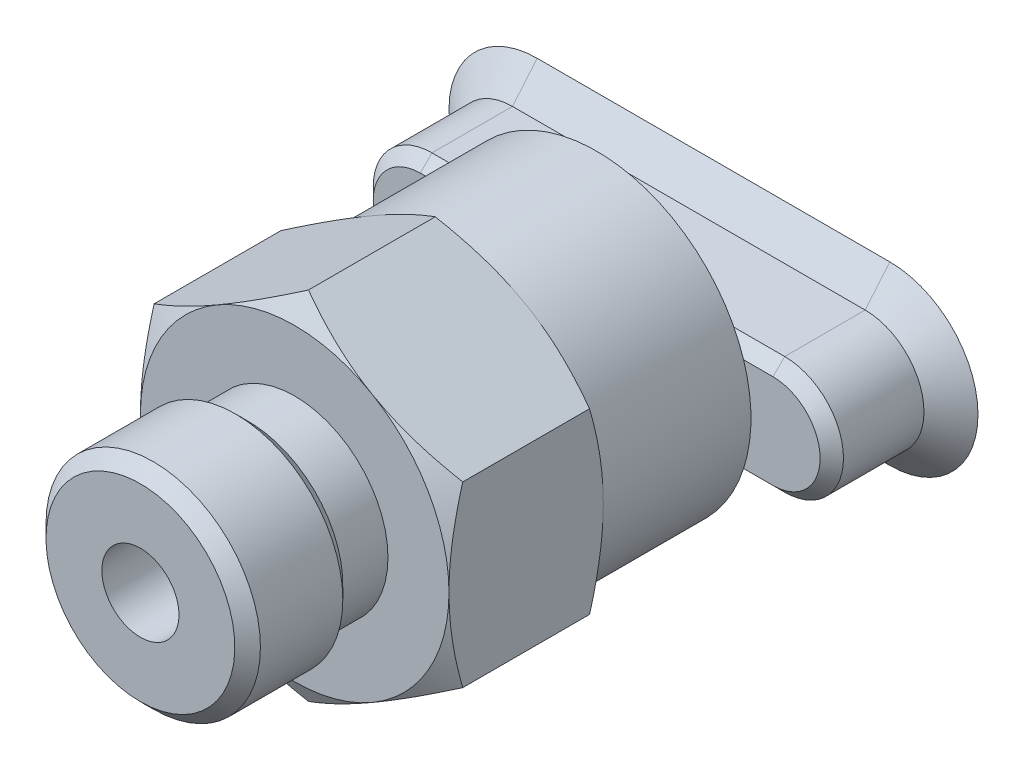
ISO-10303-21;
HEADER;
FILE_DESCRIPTION(('STEP AP214'),'2;1');
FILE_NAME('part.step','',(''),(''),'','','');
FILE_SCHEMA(('AUTOMOTIVE_DESIGN { 1 0 10303 214 1 1 1 1 }'));
ENDSEC;
DATA;
#1=APPLICATION_CONTEXT('core data for automotive mechanical design processes');
#2=APPLICATION_PROTOCOL_DEFINITION('international standard','automotive_design',2000,#1);
#3=PRODUCT_CONTEXT('',#1,'mechanical');
#4=PRODUCT('Part','Part','',(#3));
#5=PRODUCT_RELATED_PRODUCT_CATEGORY('part','',(#4));
#6=PRODUCT_DEFINITION_FORMATION('','',#4);
#7=PRODUCT_DEFINITION_CONTEXT('part definition',#1,'design');
#8=PRODUCT_DEFINITION('design','',#6,#7);
#9=PRODUCT_DEFINITION_SHAPE('','',#8);
#10=(LENGTH_UNIT() NAMED_UNIT(*) SI_UNIT(.MILLI.,.METRE.));
#11=(NAMED_UNIT(*) PLANE_ANGLE_UNIT() SI_UNIT($,.RADIAN.));
#12=(NAMED_UNIT(*) SI_UNIT($,.STERADIAN.) SOLID_ANGLE_UNIT());
#13=UNCERTAINTY_MEASURE_WITH_UNIT(LENGTH_MEASURE(1.E-05),#10,'distance_accuracy_value','');
#14=(GEOMETRIC_REPRESENTATION_CONTEXT(3) GLOBAL_UNCERTAINTY_ASSIGNED_CONTEXT((#13)) GLOBAL_UNIT_ASSIGNED_CONTEXT((#10,
#11,#12)) REPRESENTATION_CONTEXT('',''));
#15=CARTESIAN_POINT('',(0.,0.,0.));
#16=DIRECTION('',(0.,0.,1.));
#17=DIRECTION('',(1.,0.,0.));
#18=AXIS2_PLACEMENT_3D('',#15,#16,#17);
#19=CARTESIAN_POINT('',(-3.2,0.,0.514285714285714));
#20=DIRECTION('',(0.,0.,1.));
#21=DIRECTION('',(0.,1.,0.));
#22=AXIS2_PLACEMENT_3D('',#19,#20,#21);
#23=CONICAL_SURFACE('',#22,0.2,0.540419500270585);
#24=CARTESIAN_POINT('',(-3.2,0.,0.514285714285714));
#25=DIRECTION('',(0.,0.,1.));
#26=DIRECTION('',(0.,1.,0.));
#27=AXIS2_PLACEMENT_3D('',#24,#25,#26);
#28=CIRCLE('',#27,0.2);
#29=CARTESIAN_POINT('',(-3.2,0.200000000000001,0.514285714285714));
#30=VERTEX_POINT('',#29);
#31=EDGE_CURVE('E10',#30,#30,#28,.T.);
#32=ORIENTED_EDGE('',*,*,#31,.T.);
#33=EDGE_LOOP('',(#32));
#34=FACE_BOUND('',#33,.T.);
#35=CARTESIAN_POINT('',(-3.2,0.,1.5142857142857));
#36=DIRECTION('',(0.,0.,-1.));
#37=DIRECTION('',(1.,0.,0.));
#38=AXIS2_PLACEMENT_3D('',#35,#36,#37);
#39=CIRCLE('',#38,0.8);
#40=CARTESIAN_POINT('',(-2.4,0.,1.5142857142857));
#41=VERTEX_POINT('',#40);
#42=EDGE_CURVE('E630',#41,#41,#39,.T.);
#43=ORIENTED_EDGE('',*,*,#42,.T.);
#44=EDGE_LOOP('',(#43));
#45=FACE_BOUND('',#44,.T.);
#46=ADVANCED_FACE('F15',(#34,#45),#23,.T.);
#47=CARTESIAN_POINT('',(-3.2,0.,0.514285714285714));
#48=DIRECTION('',(0.,0.,1.));
#49=DIRECTION('',(-1.,0.,0.));
#50=AXIS2_PLACEMENT_3D('',#47,#48,#49);
#51=PLANE('',#50);
#52=ORIENTED_EDGE('',*,*,#31,.F.);
#53=EDGE_LOOP('',(#52));
#54=FACE_BOUND('',#53,.T.);
#55=ADVANCED_FACE('F721',(#54),#51,.F.);
#56=CARTESIAN_POINT('',(-6.8,0.,0.514285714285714));
#57=DIRECTION('',(0.,0.,1.));
#58=DIRECTION('',(0.,1.,0.));
#59=AXIS2_PLACEMENT_3D('',#56,#57,#58);
#60=CONICAL_SURFACE('',#59,0.2,0.540419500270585);
#61=CARTESIAN_POINT('',(-6.8,0.,0.514285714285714));
#62=DIRECTION('',(0.,0.,1.));
#63=DIRECTION('',(0.,1.,0.));
#64=AXIS2_PLACEMENT_3D('',#61,#62,#63);
#65=CIRCLE('',#64,0.2);
#66=CARTESIAN_POINT('',(-6.8,0.200000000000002,0.514285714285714));
#67=VERTEX_POINT('',#66);
#68=EDGE_CURVE('E28',#67,#67,#65,.T.);
#69=ORIENTED_EDGE('',*,*,#68,.T.);
#70=EDGE_LOOP('',(#69));
#71=FACE_BOUND('',#70,.T.);
#72=CARTESIAN_POINT('',(-6.8,0.,1.51428571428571));
#73=DIRECTION('',(0.,0.,-1.));
#74=DIRECTION('',(1.,0.,0.));
#75=AXIS2_PLACEMENT_3D('',#72,#73,#74);
#76=CIRCLE('',#75,0.8);
#77=CARTESIAN_POINT('',(-6.,0.,1.51428571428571));
#78=VERTEX_POINT('',#77);
#79=EDGE_CURVE('E372',#78,#78,#76,.T.);
#80=ORIENTED_EDGE('',*,*,#79,.T.);
#81=EDGE_LOOP('',(#80));
#82=FACE_BOUND('',#81,.T.);
#83=ADVANCED_FACE('F848',(#71,#82),#60,.T.);
#84=CARTESIAN_POINT('',(-6.8,0.,0.514285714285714));
#85=DIRECTION('',(0.,0.,1.));
#86=DIRECTION('',(-1.,0.,0.));
#87=AXIS2_PLACEMENT_3D('',#84,#85,#86);
#88=PLANE('',#87);
#89=ORIENTED_EDGE('',*,*,#68,.F.);
#90=EDGE_LOOP('',(#89));
#91=FACE_BOUND('',#90,.T.);
#92=ADVANCED_FACE('F1429',(#91),#88,.F.);
#93=CARTESIAN_POINT('',(3.2,0.,0.514285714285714));
#94=DIRECTION('',(0.,0.,1.));
#95=DIRECTION('',(0.,1.,0.));
#96=AXIS2_PLACEMENT_3D('',#93,#94,#95);
#97=CONICAL_SURFACE('',#96,0.2,0.540419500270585);
#98=CARTESIAN_POINT('',(3.2,0.,0.514285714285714));
#99=DIRECTION('',(0.,0.,1.));
#100=DIRECTION('',(0.,1.,0.));
#101=AXIS2_PLACEMENT_3D('',#98,#99,#100);
#102=CIRCLE('',#101,0.2);
#103=CARTESIAN_POINT('',(3.2,0.199999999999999,0.514285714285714));
#104=VERTEX_POINT('',#103);
#105=EDGE_CURVE('E362',#104,#104,#102,.T.);
#106=ORIENTED_EDGE('',*,*,#105,.T.);
#107=EDGE_LOOP('',(#106));
#108=FACE_BOUND('',#107,.T.);
#109=CARTESIAN_POINT('',(3.2,0.,1.51428571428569));
#110=DIRECTION('',(0.,0.,-1.));
#111=DIRECTION('',(1.,0.,0.));
#112=AXIS2_PLACEMENT_3D('',#109,#110,#111);
#113=CIRCLE('',#112,0.799999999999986);
#114=CARTESIAN_POINT('',(4.,0.,1.51428571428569));
#115=VERTEX_POINT('',#114);
#116=EDGE_CURVE('E564',#115,#115,#113,.T.);
#117=ORIENTED_EDGE('',*,*,#116,.T.);
#118=EDGE_LOOP('',(#117));
#119=FACE_BOUND('',#118,.T.);
#120=ADVANCED_FACE('F1515',(#108,#119),#97,.T.);
#121=CARTESIAN_POINT('',(3.2,0.,0.514285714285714));
#122=DIRECTION('',(0.,0.,1.));
#123=DIRECTION('',(-1.,0.,0.));
#124=AXIS2_PLACEMENT_3D('',#121,#122,#123);
#125=PLANE('',#124);
#126=ORIENTED_EDGE('',*,*,#105,.F.);
#127=EDGE_LOOP('',(#126));
#128=FACE_BOUND('',#127,.T.);
#129=ADVANCED_FACE('F1506',(#128),#125,.F.);
#130=CARTESIAN_POINT('',(6.8,0.,0.514285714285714));
#131=DIRECTION('',(0.,0.,1.));
#132=DIRECTION('',(0.,1.,0.));
#133=AXIS2_PLACEMENT_3D('',#130,#131,#132);
#134=CONICAL_SURFACE('',#133,0.2,0.540419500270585);
#135=CARTESIAN_POINT('',(6.8,0.,0.514285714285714));
#136=DIRECTION('',(0.,0.,1.));
#137=DIRECTION('',(0.,1.,0.));
#138=AXIS2_PLACEMENT_3D('',#135,#136,#137);
#139=CIRCLE('',#138,0.2);
#140=CARTESIAN_POINT('',(6.8,0.199999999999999,0.514285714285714));
#141=VERTEX_POINT('',#140);
#142=EDGE_CURVE('E359',#141,#141,#139,.T.);
#143=ORIENTED_EDGE('',*,*,#142,.T.);
#144=EDGE_LOOP('',(#143));
#145=FACE_BOUND('',#144,.T.);
#146=CARTESIAN_POINT('',(6.8,0.,1.51428571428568));
#147=DIRECTION('',(0.,0.,-1.));
#148=DIRECTION('',(1.,0.,0.));
#149=AXIS2_PLACEMENT_3D('',#146,#147,#148);
#150=CIRCLE('',#149,0.799999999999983);
#151=CARTESIAN_POINT('',(7.6,0.,1.51428571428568));
#152=VERTEX_POINT('',#151);
#153=EDGE_CURVE('E286',#152,#152,#150,.T.);
#154=ORIENTED_EDGE('',*,*,#153,.T.);
#155=EDGE_LOOP('',(#154));
#156=FACE_BOUND('',#155,.T.);
#157=ADVANCED_FACE('F1501',(#145,#156),#134,.T.);
#158=CARTESIAN_POINT('',(6.8,0.,0.514285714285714));
#159=DIRECTION('',(0.,0.,1.));
#160=DIRECTION('',(-1.,0.,0.));
#161=AXIS2_PLACEMENT_3D('',#158,#159,#160);
#162=PLANE('',#161);
#163=ORIENTED_EDGE('',*,*,#142,.F.);
#164=EDGE_LOOP('',(#163));
#165=FACE_BOUND('',#164,.T.);
#166=ADVANCED_FACE('F1355',(#165),#162,.F.);
#167=CARTESIAN_POINT('',(0.,0.,0.));
#168=DIRECTION('',(0.,0.,-1.));
#169=DIRECTION('',(0.,-1.,0.));
#170=AXIS2_PLACEMENT_3D('',#167,#168,#169);
#171=CYLINDRICAL_SURFACE('',#170,1.16666666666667);
#172=CARTESIAN_POINT('',(0.,0.,8.65));
#173=DIRECTION('',(0.,0.,-1.));
#174=DIRECTION('',(0.,-1.,0.));
#175=AXIS2_PLACEMENT_3D('',#172,#173,#174);
#176=CIRCLE('',#175,1.16666666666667);
#177=CARTESIAN_POINT('',(0.,-1.16666666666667,8.65));
#178=VERTEX_POINT('',#177);
#179=EDGE_CURVE('E363',#178,#178,#176,.T.);
#180=ORIENTED_EDGE('',*,*,#179,.F.);
#181=EDGE_LOOP('',(#180));
#182=FACE_BOUND('',#181,.T.);
#183=CARTESIAN_POINT('',(0.,0.,2.08485168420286));
#184=DIRECTION('',(0.,0.5,-0.866025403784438));
#185=DIRECTION('',(0.,-0.866025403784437,-0.5));
#186=AXIS2_PLACEMENT_3D('',#183,#184,#185);
#187=ELLIPSE('',#186,1.34715062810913,1.16666666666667);
#188=CARTESIAN_POINT('',(0.620060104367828,-0.988249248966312,1.5142857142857));
#189=VERTEX_POINT('',#188);
#190=CARTESIAN_POINT('',(-0.620060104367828,-0.988249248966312,1.51428571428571));
#191=VERTEX_POINT('',#190);
#192=EDGE_CURVE('E601',#189,#191,#187,.T.);
#193=ORIENTED_EDGE('',*,*,#192,.T.);
#194=CARTESIAN_POINT('',(0.,0.,1.5142857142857));
#195=DIRECTION('',(0.,0.,-1.));
#196=DIRECTION('',(1.,0.,0.));
#197=AXIS2_PLACEMENT_3D('',#194,#195,#196);
#198=CIRCLE('',#197,1.16666666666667);
#199=CARTESIAN_POINT('',(-0.620060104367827,0.988249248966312,1.51428571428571));
#200=VERTEX_POINT('',#199);
#201=EDGE_CURVE('E367',#191,#200,#198,.T.);
#202=ORIENTED_EDGE('',*,*,#201,.T.);
#203=CARTESIAN_POINT('',(0.,0.,2.08485168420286));
#204=DIRECTION('',(0.,-0.5,-0.866025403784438));
#205=DIRECTION('',(0.,0.866025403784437,-0.5));
#206=AXIS2_PLACEMENT_3D('',#203,#204,#205);
#207=ELLIPSE('',#206,1.34715062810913,1.16666666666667);
#208=CARTESIAN_POINT('',(0.620060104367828,0.988249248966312,1.5142857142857));
#209=VERTEX_POINT('',#208);
#210=EDGE_CURVE('E567',#200,#209,#207,.T.);
#211=ORIENTED_EDGE('',*,*,#210,.T.);
#212=CARTESIAN_POINT('',(0.,0.,1.5142857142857));
#213=DIRECTION('',(0.,0.,-1.));
#214=DIRECTION('',(1.,0.,0.));
#215=AXIS2_PLACEMENT_3D('',#212,#213,#214);
#216=CIRCLE('',#215,1.16666666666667);
#217=EDGE_CURVE('E191',#209,#189,#216,.T.);
#218=ORIENTED_EDGE('',*,*,#217,.T.);
#219=EDGE_LOOP('',(#193,#202,#211,#218));
#220=FACE_BOUND('',#219,.T.);
#221=ADVANCED_FACE('F1067',(#182,#220),#171,.F.);
#222=CARTESIAN_POINT('',(-1.75,0.,8.65));
#223=DIRECTION('',(0.,0.,1.));
#224=DIRECTION('',(-1.,0.,0.));
#225=AXIS2_PLACEMENT_3D('',#222,#223,#224);
#226=PLANE('',#225);
#227=CARTESIAN_POINT('',(0.,0.,8.65));
#228=DIRECTION('',(0.,0.,-1.));
#229=DIRECTION('',(-1.,0.,0.));
#230=AXIS2_PLACEMENT_3D('',#227,#228,#229);
#231=CIRCLE('',#230,1.75);
#232=CARTESIAN_POINT('',(-1.75,0.,8.65));
#233=VERTEX_POINT('',#232);
#234=EDGE_CURVE('E556',#233,#233,#231,.T.);
#235=ORIENTED_EDGE('',*,*,#234,.F.);
#236=EDGE_LOOP('',(#235));
#237=FACE_BOUND('',#236,.T.);
#238=ORIENTED_EDGE('',*,*,#179,.T.);
#239=EDGE_LOOP('',(#238));
#240=FACE_BOUND('',#239,.T.);
#241=ADVANCED_FACE('F1049',(#237,#240),#226,.T.);
#242=CARTESIAN_POINT('',(0.,0.,8.65));
#243=DIRECTION('',(0.,0.,-1.));
#244=DIRECTION('',(-1.,0.,0.));
#245=AXIS2_PLACEMENT_3D('',#242,#243,#244);
#246=CYLINDRICAL_SURFACE('',#245,1.75);
#247=CARTESIAN_POINT('',(0.,0.,26.));
#248=DIRECTION('',(0.,0.,-1.));
#249=DIRECTION('',(-1.,0.,0.));
#250=AXIS2_PLACEMENT_3D('',#247,#248,#249);
#251=CIRCLE('',#250,1.75);
#252=CARTESIAN_POINT('',(-1.75,0.,26.));
#253=VERTEX_POINT('',#252);
#254=EDGE_CURVE('E525',#253,#253,#251,.T.);
#255=ORIENTED_EDGE('',*,*,#254,.F.);
#256=EDGE_LOOP('',(#255));
#257=FACE_BOUND('',#256,.T.);
#258=ORIENTED_EDGE('',*,*,#234,.T.);
#259=EDGE_LOOP('',(#258));
#260=FACE_BOUND('',#259,.T.);
#261=ADVANCED_FACE('F902',(#257,#260),#246,.F.);
#262=CARTESIAN_POINT('',(0.,0.,19.));
#263=DIRECTION('',(0.,0.,-1.));
#264=DIRECTION('',(0.,-1.,0.));
#265=AXIS2_PLACEMENT_3D('',#262,#263,#264);
#266=CONICAL_SURFACE('',#265,7.,1.04719755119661);
#267=CARTESIAN_POINT('',(3.49999999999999,6.06217782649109,19.));
#268=CARTESIAN_POINT('',(3.35308834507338,6.14693610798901,19.0000591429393));
#269=CARTESIAN_POINT('',(3.2061582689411,6.23165765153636,18.9965268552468));
#270=CARTESIAN_POINT('',(2.91301709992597,6.40077058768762,18.9824159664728));
#271=CARTESIAN_POINT('',(2.76680515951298,6.48516222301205,18.9718579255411));
#272=CARTESIAN_POINT('',(2.47370307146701,6.65460021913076,18.9437068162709));
#273=CARTESIAN_POINT('',(2.32681839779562,6.73964575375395,18.9260522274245));
#274=CARTESIAN_POINT('',(2.03081529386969,6.91097952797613,18.8838325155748));
#275=CARTESIAN_POINT('',(1.88171047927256,6.99725887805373,18.8591370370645));
#276=CARTESIAN_POINT('',(1.59049252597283,7.16541238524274,18.804792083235));
#277=CARTESIAN_POINT('',(1.4483502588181,7.24731859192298,18.7753961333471));
#278=CARTESIAN_POINT('',(1.16304813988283,7.4117644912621,18.7108394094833));
#279=CARTESIAN_POINT('',(1.01990109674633,7.49429745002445,18.6756050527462));
#280=CARTESIAN_POINT('',(0.731787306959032,7.66048098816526,18.5994288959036));
#281=CARTESIAN_POINT('',(0.586841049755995,7.74412111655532,18.5583874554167));
#282=CARTESIAN_POINT('',(0.294394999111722,7.91292090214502,18.4706123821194));
#283=CARTESIAN_POINT('',(0.146921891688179,7.99806631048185,18.4237621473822));
#284=CARTESIAN_POINT('',(0.,8.08290376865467,18.3747852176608));
#285=B_SPLINE_CURVE_WITH_KNOTS('',3,(#267,#268,#269,#270,#271,#272,#273,#274,#275,#276,#277,
#278,#279,#280,#281,#282,#283,#284),.UNSPECIFIED.,.F.,.F.,(4,2,2,2,2,2,2,2,4),(0.,
0.508782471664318,1.01608255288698,1.52787871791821,2.04984538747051,2.54974887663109,
3.05651334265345,3.57336423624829,4.10312902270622),.UNSPECIFIED.);
#286=CARTESIAN_POINT('',(3.5,6.06217782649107,19.));
#287=VERTEX_POINT('',#286);
#288=CARTESIAN_POINT('',(0.,8.08290376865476,18.3747852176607));
#289=VERTEX_POINT('',#288);
#290=EDGE_CURVE('E1211',#287,#289,#285,.T.);
#291=ORIENTED_EDGE('',*,*,#290,.T.);
#292=CARTESIAN_POINT('',(0.,8.0829037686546,18.3747852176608));
#293=CARTESIAN_POINT('',(-0.146927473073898,7.99806360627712,18.423763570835));
#294=CARTESIAN_POINT('',(-0.294400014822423,7.91290738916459,18.4706200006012));
#295=CARTESIAN_POINT('',(-0.58680560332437,7.74409607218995,18.5584030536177));
#296=CARTESIAN_POINT('',(-0.731711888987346,7.6604555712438,18.5994471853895));
#297=CARTESIAN_POINT('',(-1.01971164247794,7.49428850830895,18.6756240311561));
#298=CARTESIAN_POINT('',(-1.16278441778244,7.41177255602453,18.7108574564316));
#299=CARTESIAN_POINT('',(-1.44790693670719,7.24738166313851,18.7754092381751));
#300=CARTESIAN_POINT('',(-1.58994364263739,7.16551353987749,18.8048023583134));
#301=CARTESIAN_POINT('',(-1.8810036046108,6.9974317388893,18.859145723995));
#302=CARTESIAN_POINT('',(-2.03005677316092,6.91118665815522,18.8838404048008));
#303=CARTESIAN_POINT('',(-2.32603439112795,6.73990304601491,18.926059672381));
#304=CARTESIAN_POINT('',(-2.47294528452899,6.65487283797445,18.9437119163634));
#305=CARTESIAN_POINT('',(-2.76616683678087,6.4854293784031,18.9718619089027));
#306=CARTESIAN_POINT('',(-2.91247229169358,6.40101689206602,18.9824180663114));
#307=CARTESIAN_POINT('',(-3.2058599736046,6.23181231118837,18.9965286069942));
#308=CARTESIAN_POINT('',(-3.35294315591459,6.14701989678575,19.0000592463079));
#309=CARTESIAN_POINT('',(-3.5,6.06217782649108,19.));
#310=B_SPLINE_CURVE_WITH_KNOTS('',3,(#292,#293,#294,#295,#296,#297,#298,#299,#300,#301,#302,
#303,#304,#305,#306,#307,#308,#309),.UNSPECIFIED.,.F.,.F.,(4,2,2,2,2,2,2,2,4),(0.,
0.529784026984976,1.04653669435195,1.55308704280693,2.05266281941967,2.57444501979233,
3.08628486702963,3.59385834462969,4.10314436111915),.UNSPECIFIED.);
#311=CARTESIAN_POINT('',(-3.5,6.06217782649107,19.));
#312=VERTEX_POINT('',#311);
#313=EDGE_CURVE('E1202',#289,#312,#310,.T.);
#314=ORIENTED_EDGE('',*,*,#313,.T.);
#315=CARTESIAN_POINT('',(0.,0.,19.));
#316=DIRECTION('',(0.,0.,-1.));
#317=DIRECTION('',(0.,-1.,0.));
#318=AXIS2_PLACEMENT_3D('',#315,#316,#317);
#319=CIRCLE('',#318,7.);
#320=EDGE_CURVE('E920',#312,#287,#319,.T.);
#321=ORIENTED_EDGE('',*,*,#320,.T.);
#322=EDGE_LOOP('',(#291,#314,#321));
#323=FACE_BOUND('',#322,.T.);
#324=ADVANCED_FACE('F1151',(#323),#266,.T.);
#325=CARTESIAN_POINT('',(-4.23168,0.,19.));
#326=DIRECTION('',(0.,0.,-1.));
#327=DIRECTION('',(0.,-1.,0.));
#328=AXIS2_PLACEMENT_3D('',#325,#326,#327);
#329=PLANE('',#328);
#330=CARTESIAN_POINT('',(0.,0.,19.));
#331=DIRECTION('',(0.,0.,-1.));
#332=DIRECTION('',(0.,-1.,0.));
#333=AXIS2_PLACEMENT_3D('',#330,#331,#332);
#334=CIRCLE('',#333,4.23168);
#335=CARTESIAN_POINT('',(0.,-4.23168,19.));
#336=VERTEX_POINT('',#335);
#337=EDGE_CURVE('E587',#336,#336,#334,.T.);
#338=ORIENTED_EDGE('',*,*,#337,.T.);
#339=EDGE_LOOP('',(#338));
#340=FACE_BOUND('',#339,.T.);
#341=CARTESIAN_POINT('',(0.,0.,19.));
#342=DIRECTION('',(0.,0.,-1.));
#343=DIRECTION('',(0.,-1.,0.));
#344=AXIS2_PLACEMENT_3D('',#341,#342,#343);
#345=CIRCLE('',#344,7.);
#346=CARTESIAN_POINT('',(-7.,0.,19.));
#347=VERTEX_POINT('',#346);
#348=EDGE_CURVE('E676',#347,#312,#345,.T.);
#349=ORIENTED_EDGE('',*,*,#348,.F.);
#350=CARTESIAN_POINT('',(0.,0.,19.));
#351=DIRECTION('',(0.,0.,-1.));
#352=DIRECTION('',(0.,-1.,0.));
#353=AXIS2_PLACEMENT_3D('',#350,#351,#352);
#354=CIRCLE('',#353,7.);
#355=CARTESIAN_POINT('',(-3.5,-6.06217782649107,19.));
#356=VERTEX_POINT('',#355);
#357=EDGE_CURVE('E747',#356,#347,#354,.T.);
#358=ORIENTED_EDGE('',*,*,#357,.F.);
#359=CARTESIAN_POINT('',(0.,0.,19.));
#360=DIRECTION('',(0.,0.,-1.));
#361=DIRECTION('',(0.,-1.,0.));
#362=AXIS2_PLACEMENT_3D('',#359,#360,#361);
#363=CIRCLE('',#362,7.);
#364=CARTESIAN_POINT('',(3.5,-6.06217782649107,19.));
#365=VERTEX_POINT('',#364);
#366=EDGE_CURVE('E916',#365,#356,#363,.T.);
#367=ORIENTED_EDGE('',*,*,#366,.F.);
#368=CARTESIAN_POINT('',(0.,0.,19.));
#369=DIRECTION('',(0.,0.,-1.));
#370=DIRECTION('',(0.,-1.,0.));
#371=AXIS2_PLACEMENT_3D('',#368,#369,#370);
#372=CIRCLE('',#371,7.);
#373=CARTESIAN_POINT('',(7.,0.,19.));
#374=VERTEX_POINT('',#373);
#375=EDGE_CURVE('E692',#374,#365,#372,.T.);
#376=ORIENTED_EDGE('',*,*,#375,.F.);
#377=CARTESIAN_POINT('',(0.,0.,19.));
#378=DIRECTION('',(0.,0.,-1.));
#379=DIRECTION('',(0.,-1.,0.));
#380=AXIS2_PLACEMENT_3D('',#377,#378,#379);
#381=CIRCLE('',#380,7.);
#382=EDGE_CURVE('E683',#287,#374,#381,.T.);
#383=ORIENTED_EDGE('',*,*,#382,.F.);
#384=ORIENTED_EDGE('',*,*,#320,.F.);
#385=EDGE_LOOP('',(#349,#358,#367,#376,#383,#384));
#386=FACE_BOUND('',#385,.T.);
#387=ADVANCED_FACE('F439',(#340,#386),#329,.F.);
#388=CARTESIAN_POINT('',(0.,0.,19.));
#389=DIRECTION('',(0.,0.,-1.));
#390=DIRECTION('',(0.,-1.,0.));
#391=AXIS2_PLACEMENT_3D('',#388,#389,#390);
#392=CONICAL_SURFACE('',#391,7.,1.04719755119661);
#393=CARTESIAN_POINT('',(-7.00000000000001,0.,19.));
#394=CARTESIAN_POINT('',(-6.99994661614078,-0.170186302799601,19.000059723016));
#395=CARTESIAN_POINT('',(-6.99983662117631,-0.340370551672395,18.9965120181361));
#396=CARTESIAN_POINT('',(-6.99967657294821,-0.679874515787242,18.982333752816));
#397=CARTESIAN_POINT('',(-6.99962632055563,-0.849195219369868,18.9717269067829));
#398=CARTESIAN_POINT('',(-6.99975681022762,-1.18868657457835,18.9434418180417));
#399=CARTESIAN_POINT('',(-6.99993951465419,-1.35885225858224,18.9257043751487));
#400=CARTESIAN_POINT('',(-7.00028104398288,-1.70168562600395,18.8832834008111));
#401=CARTESIAN_POINT('',(-7.0004393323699,-1.87433720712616,18.8584708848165));
#402=CARTESIAN_POINT('',(-7.00046230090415,-2.21044341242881,18.8040089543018));
#403=CARTESIAN_POINT('',(-7.00034059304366,-2.37394475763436,18.7746458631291));
#404=CARTESIAN_POINT('',(-7.00014695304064,-2.70219967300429,18.7101788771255));
#405=CARTESIAN_POINT('',(-7.00007574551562,-2.86693848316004,18.6750000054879));
#406=CARTESIAN_POINT('',(-6.99998989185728,-3.19859946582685,18.5989579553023));
#407=CARTESIAN_POINT('',(-6.99997641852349,-3.36549843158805,18.5579942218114));
#408=CARTESIAN_POINT('',(-6.99997612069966,-3.70231135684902,18.4703969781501));
#409=CARTESIAN_POINT('',(-6.99998997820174,-3.87219493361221,18.4236463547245));
#410=CARTESIAN_POINT('',(-7.00000000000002,-4.04145188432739,18.3747852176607));
#411=B_SPLINE_CURVE_WITH_KNOTS('',3,(#393,#394,#395,#396,#397,#398,#399,#400,#401,#402,#403,
#404,#405,#406,#407,#408,#409,#410),.UNSPECIFIED.,.F.,.F.,(4,2,2,2,2,2,2,2,4),(0.,
0.510516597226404,1.01932676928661,1.53245146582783,2.05560510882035,2.55386624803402,
3.05913960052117,3.57462970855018,4.10314572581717),.UNSPECIFIED.);
#412=CARTESIAN_POINT('',(-7.,-4.04145188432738,18.3747852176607));
#413=VERTEX_POINT('',#412);
#414=EDGE_CURVE('E1313',#347,#413,#411,.T.);
#415=ORIENTED_EDGE('',*,*,#414,.T.);
#416=CARTESIAN_POINT('',(-6.99999999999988,-4.04145188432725,18.3747852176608));
#417=CARTESIAN_POINT('',(-6.85306252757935,-4.12627472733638,18.4237635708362));
#418=CARTESIAN_POINT('',(-6.70557880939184,-4.21141158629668,18.4706200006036));
#419=CARTESIAN_POINT('',(-6.41318112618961,-4.38023659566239,18.5584030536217));
#420=CARTESIAN_POINT('',(-6.26829318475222,-4.46390886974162,18.5994471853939));
#421=CARTESIAN_POINT('',(-5.9803884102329,-4.63024044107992,18.6756240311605));
#422=CARTESIAN_POINT('',(-5.83739111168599,-4.71288712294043,18.7108574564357));
#423=CARTESIAN_POINT('',(-5.55246316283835,-4.87761502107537,18.7754092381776));
#424=CARTESIAN_POINT('',(-5.41054493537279,-4.95968835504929,18.8048023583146));
#425=CARTESIAN_POINT('',(-5.11945184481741,-5.12771277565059,18.8591457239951));
#426=CARTESIAN_POINT('',(-4.97023482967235,-5.2136740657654,18.8838404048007));
#427=CARTESIAN_POINT('',(-4.67391006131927,-5.38435639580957,18.9260596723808));
#428=CARTESIAN_POINT('',(-4.5268162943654,-5.46906985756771,18.9437119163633));
#429=CARTESIAN_POINT('',(-4.23346317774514,-5.63828544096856,18.9718619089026));
#430=CARTESIAN_POINT('',(-4.08720709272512,-5.72278343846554,18.9824180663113));
#431=CARTESIAN_POINT('',(-3.7939777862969,-5.8922623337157,18.9965286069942));
#432=CARTESIAN_POINT('',(-3.64700381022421,-5.97724389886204,19.0000592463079));
#433=CARTESIAN_POINT('',(-3.50000000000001,-6.06217782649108,19.));
#434=B_SPLINE_CURVE_WITH_KNOTS('',3,(#416,#417,#418,#419,#420,#421,#422,#423,#424,#425,#426,
#427,#428,#429,#430,#431,#432,#433),.UNSPECIFIED.,.F.,.F.,(4,2,2,2,2,2,2,2,4),(0.,
0.52978402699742,1.04653669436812,1.55308704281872,2.05266281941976,2.57444501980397,
3.08628486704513,3.59385834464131,4.10314436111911),.UNSPECIFIED.);
#435=EDGE_CURVE('E1881',#413,#356,#434,.T.);
#436=ORIENTED_EDGE('',*,*,#435,.T.);
#437=ORIENTED_EDGE('',*,*,#357,.T.);
#438=EDGE_LOOP('',(#415,#436,#437));
#439=FACE_BOUND('',#438,.T.);
#440=ADVANCED_FACE('F899',(#439),#392,.T.);
#441=CARTESIAN_POINT('',(0.,0.,19.));
#442=DIRECTION('',(0.,0.,-1.));
#443=DIRECTION('',(0.,-1.,0.));
#444=AXIS2_PLACEMENT_3D('',#441,#442,#443);
#445=CONICAL_SURFACE('',#444,7.,1.04719755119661);
#446=ORIENTED_EDGE('',*,*,#366,.T.);
#447=CARTESIAN_POINT('',(-3.50000000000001,-6.06217782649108,19.));
#448=CARTESIAN_POINT('',(-3.3530883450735,-6.14693610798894,19.0000591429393));
#449=CARTESIAN_POINT('',(-3.20615826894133,-6.23165765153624,18.9965268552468));
#450=CARTESIAN_POINT('',(-2.91301709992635,-6.40077058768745,18.9824159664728));
#451=CARTESIAN_POINT('',(-2.7668051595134,-6.48516222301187,18.9718579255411));
#452=CARTESIAN_POINT('',(-2.47370307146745,-6.65460021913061,18.9437068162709));
#453=CARTESIAN_POINT('',(-2.32681839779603,-6.73964575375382,18.9260522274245));
#454=CARTESIAN_POINT('',(-2.03081529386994,-6.91097952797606,18.8838325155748));
#455=CARTESIAN_POINT('',(-1.88171047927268,-6.99725887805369,18.8591370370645));
#456=CARTESIAN_POINT('',(-1.59049252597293,-7.16541238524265,18.8047920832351));
#457=CARTESIAN_POINT('',(-1.44835025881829,-7.2473185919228,18.7753961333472));
#458=CARTESIAN_POINT('',(-1.16304813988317,-7.41176449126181,18.7108394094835));
#459=CARTESIAN_POINT('',(-1.01990109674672,-7.49429745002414,18.6756050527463));
#460=CARTESIAN_POINT('',(-0.73178730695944,-7.66048098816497,18.5994288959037));
#461=CARTESIAN_POINT('',(-0.586841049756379,-7.74412111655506,18.5583874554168));
#462=CARTESIAN_POINT('',(-0.294394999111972,-7.91292090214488,18.4706123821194));
#463=CARTESIAN_POINT('',(-0.146921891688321,-7.99806631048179,18.4237621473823));
#464=CARTESIAN_POINT('',(0.,-8.08290376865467,18.3747852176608));
#465=B_SPLINE_CURVE_WITH_KNOTS('',3,(#447,#448,#449,#450,#451,#452,#453,#454,#455,#456,#457,
#458,#459,#460,#461,#462,#463,#464),.UNSPECIFIED.,.F.,.F.,(4,2,2,2,2,2,2,2,4),(0.,
0.508782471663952,1.0160825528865,1.52787871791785,2.04984538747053,2.5497488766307,
3.0565133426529,3.57336423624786,4.10312902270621),.UNSPECIFIED.);
#466=CARTESIAN_POINT('',(0.,-8.08290376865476,18.3747852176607));
#467=VERTEX_POINT('',#466);
#468=EDGE_CURVE('E914',#356,#467,#465,.T.);
#469=ORIENTED_EDGE('',*,*,#468,.T.);
#470=CARTESIAN_POINT('',(0.,-8.0829037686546,18.3747852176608));
#471=CARTESIAN_POINT('',(0.146927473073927,-7.99806360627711,18.423763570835));
#472=CARTESIAN_POINT('',(0.294400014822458,-7.91290738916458,18.4706200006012));
#473=CARTESIAN_POINT('',(0.586805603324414,-7.74409607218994,18.5584030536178));
#474=CARTESIAN_POINT('',(0.731711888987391,-7.66045557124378,18.5994471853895));
#475=CARTESIAN_POINT('',(1.01971164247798,-7.49428850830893,18.6756240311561));
#476=CARTESIAN_POINT('',(1.16278441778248,-7.41177255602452,18.7108574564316));
#477=CARTESIAN_POINT('',(1.4479069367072,-7.2473816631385,18.7754092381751));
#478=CARTESIAN_POINT('',(1.58994364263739,-7.16551353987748,18.8048023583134));
#479=CARTESIAN_POINT('',(1.88100360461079,-6.9974317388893,18.859145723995));
#480=CARTESIAN_POINT('',(2.03005677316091,-6.91118665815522,18.8838404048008));
#481=CARTESIAN_POINT('',(2.32603439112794,-6.73990304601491,18.926059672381));
#482=CARTESIAN_POINT('',(2.47294528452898,-6.65487283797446,18.9437119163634));
#483=CARTESIAN_POINT('',(2.76616683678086,-6.48542937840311,18.9718619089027));
#484=CARTESIAN_POINT('',(2.91247229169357,-6.40101689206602,18.9824180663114));
#485=CARTESIAN_POINT('',(3.20585997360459,-6.23181231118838,18.9965286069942));
#486=CARTESIAN_POINT('',(3.35294315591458,-6.14701989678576,19.0000592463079));
#487=CARTESIAN_POINT('',(3.49999999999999,-6.06217782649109,19.));
#488=B_SPLINE_CURVE_WITH_KNOTS('',3,(#470,#471,#472,#473,#474,#475,#476,#477,#478,#479,#480,
#481,#482,#483,#484,#485,#486,#487),.UNSPECIFIED.,.F.,.F.,(4,2,2,2,2,2,2,2,4),(0.,
0.529784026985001,1.04653669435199,1.55308704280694,2.05266281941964,2.57444501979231,
3.0862848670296,3.59385834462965,4.10314436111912),.UNSPECIFIED.);
#489=EDGE_CURVE('E882',#467,#365,#488,.T.);
#490=ORIENTED_EDGE('',*,*,#489,.T.);
#491=EDGE_LOOP('',(#446,#469,#490));
#492=FACE_BOUND('',#491,.T.);
#493=ADVANCED_FACE('F889',(#492),#445,.T.);
#494=CARTESIAN_POINT('',(0.,0.,19.));
#495=DIRECTION('',(0.,0.,-1.));
#496=DIRECTION('',(0.,-1.,0.));
#497=AXIS2_PLACEMENT_3D('',#494,#495,#496);
#498=CONICAL_SURFACE('',#497,7.,1.04719755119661);
#499=ORIENTED_EDGE('',*,*,#375,.T.);
#500=CARTESIAN_POINT('',(3.49999999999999,-6.06217782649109,19.));
#501=CARTESIAN_POINT('',(3.64685865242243,-5.97732774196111,19.0000591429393));
#502=CARTESIAN_POINT('',(3.79369469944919,-5.89244333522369,18.9965268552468));
#503=CARTESIAN_POINT('',(4.08672138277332,-5.72313210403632,18.9824159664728));
#504=CARTESIAN_POINT('',(4.23291265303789,-5.63870466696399,18.9718579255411));
#505=CARTESIAN_POINT('',(4.52620130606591,-5.46958981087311,18.9437068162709));
#506=CARTESIAN_POINT('',(4.67329523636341,-5.38490671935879,18.9260522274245));
#507=CARTESIAN_POINT('',(4.96967618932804,-5.21422739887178,18.8838325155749));
#508=CARTESIAN_POINT('',(5.11894870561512,-5.12823851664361,18.8591370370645));
#509=CARTESIAN_POINT('',(5.41018289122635,-4.9601131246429,18.8047920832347));
#510=CARTESIAN_POINT('',(5.55218688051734,-4.87796741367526,18.7753961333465));
#511=CARTESIAN_POINT('',(5.83725226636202,-4.71311148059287,18.7108394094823));
#512=CARTESIAN_POINT('',(5.98030142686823,-4.63040898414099,18.6756050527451));
#513=CARTESIAN_POINT('',(6.26827748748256,-4.46398689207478,18.5994288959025));
#514=CARTESIAN_POINT('',(6.41318509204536,-4.38027981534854,18.5583874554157));
#515=CARTESIAN_POINT('',(6.70559301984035,-4.21141399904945,18.4706123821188));
#516=CARTESIAN_POINT('',(6.85306766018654,-4.12627124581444,18.423762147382));
#517=CARTESIAN_POINT('',(6.99999999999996,-4.04145188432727,18.3747852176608));
#518=B_SPLINE_CURVE_WITH_KNOTS('',3,(#500,#501,#502,#503,#504,#505,#506,#507,#508,#509,#510,
#511,#512,#513,#514,#515,#516,#517),.UNSPECIFIED.,.F.,.F.,(4,2,2,2,2,2,2,2,4),(0.,
0.508782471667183,1.01608255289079,1.52787871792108,2.04984538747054,2.549748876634,
3.05651334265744,3.57336423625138,4.1031290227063),.UNSPECIFIED.);
#519=CARTESIAN_POINT('',(7.,-4.04145188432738,18.3747852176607));
#520=VERTEX_POINT('',#519);
#521=EDGE_CURVE('E873',#365,#520,#518,.T.);
#522=ORIENTED_EDGE('',*,*,#521,.T.);
#523=CARTESIAN_POINT('',(7.00000000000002,-4.0414518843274,18.3747852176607));
#524=CARTESIAN_POINT('',(6.99999015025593,-3.8721656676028,18.4236546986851));
#525=CARTESIAN_POINT('',(6.99997503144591,-3.70225279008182,18.4704136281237));
#526=CARTESIAN_POINT('',(6.99997071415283,-3.36538368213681,18.5580261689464));
#527=CARTESIAN_POINT('',(6.9999808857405,-3.19845785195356,18.5989969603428));
#528=CARTESIAN_POINT('',(7.00005883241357,-2.86674530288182,18.6750515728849));
#529=CARTESIAN_POINT('',(7.00012546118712,-2.70198180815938,18.7102360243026));
#530=CARTESIAN_POINT('',(7.00030668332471,-2.37367962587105,18.7747138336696));
#531=CARTESIAN_POINT('',(7.00042059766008,-2.21015571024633,18.8040822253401));
#532=CARTESIAN_POINT('',(7.00038714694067,-1.8740930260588,18.8585356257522));
#533=CARTESIAN_POINT('',(7.00022659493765,-1.70150802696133,18.8833373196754));
#534=CARTESIAN_POINT('',(6.99989024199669,-1.35877998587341,18.9257397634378));
#535=CARTESIAN_POINT('',(6.99971478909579,-1.18865291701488,18.9434684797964));
#536=CARTESIAN_POINT('',(6.99960001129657,-0.849212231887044,18.9717406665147));
#537=CARTESIAN_POINT('',(6.99965874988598,-0.679903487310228,18.9823422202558));
#538=CARTESIAN_POINT('',(6.99983193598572,-0.340397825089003,18.9965141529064));
#539=CARTESIAN_POINT('',(6.9999465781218,-0.170199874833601,19.0000597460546));
#540=CARTESIAN_POINT('',(7.00000000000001,0.,19.));
#541=B_SPLINE_CURVE_WITH_KNOTS('',3,(#523,#524,#525,#526,#527,#528,#529,#530,#531,#532,#533,
#534,#535,#536,#537,#538,#539,#540),.UNSPECIFIED.,.F.,.F.,(4,2,2,2,2,2,2,2,4),(0.,
0.528607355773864,1.0441807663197,1.54953004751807,2.04786057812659,2.57081184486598,
3.0838185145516,3.59259200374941,4.10314954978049),.UNSPECIFIED.);
#542=EDGE_CURVE('E874',#520,#374,#541,.T.);
#543=ORIENTED_EDGE('',*,*,#542,.T.);
#544=EDGE_LOOP('',(#499,#522,#543));
#545=FACE_BOUND('',#544,.T.);
#546=ADVANCED_FACE('F397',(#545),#498,.T.);
#547=CARTESIAN_POINT('',(0.,0.,19.));
#548=DIRECTION('',(0.,0.,-1.));
#549=DIRECTION('',(0.,-1.,0.));
#550=AXIS2_PLACEMENT_3D('',#547,#548,#549);
#551=CONICAL_SURFACE('',#550,7.,1.04719755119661);
#552=ORIENTED_EDGE('',*,*,#382,.T.);
#553=CARTESIAN_POINT('',(7.00000000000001,0.,19.));
#554=CARTESIAN_POINT('',(6.99994661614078,0.170186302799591,19.000059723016));
#555=CARTESIAN_POINT('',(6.99983662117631,0.340370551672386,18.9965120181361));
#556=CARTESIAN_POINT('',(6.99967657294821,0.679874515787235,18.982333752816));
#557=CARTESIAN_POINT('',(6.99962632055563,0.849195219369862,18.9717269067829));
#558=CARTESIAN_POINT('',(6.99975681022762,1.18868657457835,18.9434418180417));
#559=CARTESIAN_POINT('',(6.99993951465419,1.35885225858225,18.9257043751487));
#560=CARTESIAN_POINT('',(7.00028104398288,1.70168562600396,18.8832834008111));
#561=CARTESIAN_POINT('',(7.00043933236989,1.87433720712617,18.8584708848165));
#562=CARTESIAN_POINT('',(7.00046230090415,2.21044341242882,18.8040089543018));
#563=CARTESIAN_POINT('',(7.00034059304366,2.37394475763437,18.7746458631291));
#564=CARTESIAN_POINT('',(7.00014695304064,2.7021996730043,18.7101788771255));
#565=CARTESIAN_POINT('',(7.00007574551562,2.86693848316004,18.6750000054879));
#566=CARTESIAN_POINT('',(6.99998989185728,3.19859946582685,18.5989579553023));
#567=CARTESIAN_POINT('',(6.99997641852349,3.36549843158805,18.5579942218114));
#568=CARTESIAN_POINT('',(6.99997612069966,3.70231135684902,18.4703969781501));
#569=CARTESIAN_POINT('',(6.99998997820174,3.87219493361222,18.4236463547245));
#570=CARTESIAN_POINT('',(7.00000000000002,4.0414518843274,18.3747852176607));
#571=B_SPLINE_CURVE_WITH_KNOTS('',3,(#553,#554,#555,#556,#557,#558,#559,#560,#561,#562,#563,
#564,#565,#566,#567,#568,#569,#570),.UNSPECIFIED.,.F.,.F.,(4,2,2,2,2,2,2,2,4),(0.,
0.510516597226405,1.01932676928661,1.53245146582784,2.05560510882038,2.55386624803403,
3.05913960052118,3.57462970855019,4.10314572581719),.UNSPECIFIED.);
#572=CARTESIAN_POINT('',(7.,4.04145188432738,18.3747852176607));
#573=VERTEX_POINT('',#572);
#574=EDGE_CURVE('E420',#374,#573,#571,.T.);
#575=ORIENTED_EDGE('',*,*,#574,.T.);
#576=CARTESIAN_POINT('',(6.99999999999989,4.04145188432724,18.3747852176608));
#577=CARTESIAN_POINT('',(6.85306252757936,4.12627472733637,18.4237635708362));
#578=CARTESIAN_POINT('',(6.70557880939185,4.21141158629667,18.4706200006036));
#579=CARTESIAN_POINT('',(6.41318112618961,4.38023659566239,18.5584030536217));
#580=CARTESIAN_POINT('',(6.26829318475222,4.46390886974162,18.5994471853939));
#581=CARTESIAN_POINT('',(5.9803884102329,4.63024044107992,18.6756240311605));
#582=CARTESIAN_POINT('',(5.83739111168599,4.71288712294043,18.7108574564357));
#583=CARTESIAN_POINT('',(5.55246316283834,4.87761502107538,18.7754092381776));
#584=CARTESIAN_POINT('',(5.41054493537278,4.9596883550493,18.8048023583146));
#585=CARTESIAN_POINT('',(5.1194518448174,5.12771277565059,18.8591457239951));
#586=CARTESIAN_POINT('',(4.97023482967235,5.2136740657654,18.8838404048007));
#587=CARTESIAN_POINT('',(4.67391006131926,5.38435639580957,18.9260596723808));
#588=CARTESIAN_POINT('',(4.52681629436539,5.46906985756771,18.9437119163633));
#589=CARTESIAN_POINT('',(4.23346317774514,5.63828544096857,18.9718619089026));
#590=CARTESIAN_POINT('',(4.08720709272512,5.72278343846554,18.9824180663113));
#591=CARTESIAN_POINT('',(3.7939777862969,5.89226233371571,18.9965286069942));
#592=CARTESIAN_POINT('',(3.6470038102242,5.97724389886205,19.0000592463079));
#593=CARTESIAN_POINT('',(3.49999999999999,6.06217782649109,19.));
#594=B_SPLINE_CURVE_WITH_KNOTS('',3,(#576,#577,#578,#579,#580,#581,#582,#583,#584,#585,#586,
#587,#588,#589,#590,#591,#592,#593),.UNSPECIFIED.,.F.,.F.,(4,2,2,2,2,2,2,2,4),(0.,
0.52978402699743,1.04653669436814,1.55308704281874,2.05266281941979,2.57444501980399,
3.08628486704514,3.59385834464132,4.10314436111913),.UNSPECIFIED.);
#595=EDGE_CURVE('E379',#573,#287,#594,.T.);
#596=ORIENTED_EDGE('',*,*,#595,.T.);
#597=EDGE_LOOP('',(#552,#575,#596));
#598=FACE_BOUND('',#597,.T.);
#599=ADVANCED_FACE('F386',(#598),#551,.T.);
#600=CARTESIAN_POINT('',(0.,0.,19.));
#601=DIRECTION('',(0.,0.,-1.));
#602=DIRECTION('',(0.,-1.,0.));
#603=AXIS2_PLACEMENT_3D('',#600,#601,#602);
#604=CONICAL_SURFACE('',#603,7.,1.04719755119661);
#605=CARTESIAN_POINT('',(-3.5,6.06217782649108,19.));
#606=CARTESIAN_POINT('',(-3.64685865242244,5.97732774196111,19.0000591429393));
#607=CARTESIAN_POINT('',(-3.7936946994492,5.89244333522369,18.9965268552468));
#608=CARTESIAN_POINT('',(-4.08672138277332,5.72313210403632,18.9824159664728));
#609=CARTESIAN_POINT('',(-4.23291265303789,5.63870466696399,18.9718579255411));
#610=CARTESIAN_POINT('',(-4.52620130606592,5.4695898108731,18.9437068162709));
#611=CARTESIAN_POINT('',(-4.67329523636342,5.38490671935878,18.9260522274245));
#612=CARTESIAN_POINT('',(-4.96967618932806,5.21422739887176,18.8838325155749));
#613=CARTESIAN_POINT('',(-5.11894870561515,5.12823851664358,18.8591370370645));
#614=CARTESIAN_POINT('',(-5.41018289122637,4.96011312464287,18.8047920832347));
#615=CARTESIAN_POINT('',(-5.55218688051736,4.87796741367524,18.7753961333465));
#616=CARTESIAN_POINT('',(-5.83725226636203,4.71311148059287,18.7108394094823));
#617=CARTESIAN_POINT('',(-5.98030142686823,4.63040898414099,18.6756050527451));
#618=CARTESIAN_POINT('',(-6.26827748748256,4.46398689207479,18.5994288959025));
#619=CARTESIAN_POINT('',(-6.41318509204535,4.38027981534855,18.5583874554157));
#620=CARTESIAN_POINT('',(-6.70559301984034,4.21141399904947,18.4706123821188));
#621=CARTESIAN_POINT('',(-6.85306766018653,4.12627124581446,18.423762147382));
#622=CARTESIAN_POINT('',(-6.99999999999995,4.0414518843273,18.3747852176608));
#623=B_SPLINE_CURVE_WITH_KNOTS('',3,(#605,#606,#607,#608,#609,#610,#611,#612,#613,#614,#615,
#616,#617,#618,#619,#620,#621,#622),.UNSPECIFIED.,.F.,.F.,(4,2,2,2,2,2,2,2,4),(0.,
0.508782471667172,1.01608255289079,1.52787871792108,2.04984538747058,2.549748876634,
3.05651334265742,3.57336423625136,4.10312902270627),.UNSPECIFIED.);
#624=CARTESIAN_POINT('',(-7.,4.04145188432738,18.3747852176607));
#625=VERTEX_POINT('',#624);
#626=EDGE_CURVE('E704',#312,#625,#623,.T.);
#627=ORIENTED_EDGE('',*,*,#626,.T.);
#628=CARTESIAN_POINT('',(-7.00000000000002,4.04145188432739,18.3747852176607));
#629=CARTESIAN_POINT('',(-6.99999015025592,3.87216566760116,18.4236546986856));
#630=CARTESIAN_POINT('',(-6.99997503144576,3.70225279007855,18.4704136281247));
#631=CARTESIAN_POINT('',(-6.99997071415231,3.36538368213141,18.558026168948));
#632=CARTESIAN_POINT('',(-6.99998088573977,3.19845785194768,18.5989969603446));
#633=CARTESIAN_POINT('',(-7.00005883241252,2.86674530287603,18.6750515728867));
#634=CARTESIAN_POINT('',(-7.00012546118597,2.70198180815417,18.7102360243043));
#635=CARTESIAN_POINT('',(-7.00030668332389,2.37367962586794,18.7747138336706));
#636=CARTESIAN_POINT('',(-7.00042059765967,2.21015571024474,18.8040822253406));
#637=CARTESIAN_POINT('',(-7.00038714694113,1.87409302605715,18.8585356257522));
#638=CARTESIAN_POINT('',(-7.00022659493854,1.70150802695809,18.8833373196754));
#639=CARTESIAN_POINT('',(-6.9998902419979,1.35877998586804,18.9257397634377));
#640=CARTESIAN_POINT('',(-6.99971478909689,1.18865291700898,18.9434684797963));
#641=CARTESIAN_POINT('',(-6.99960001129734,0.849212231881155,18.9717406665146));
#642=CARTESIAN_POINT('',(-6.99965874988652,0.679903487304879,18.9823422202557));
#643=CARTESIAN_POINT('',(-6.99983193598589,0.340397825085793,18.9965141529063));
#644=CARTESIAN_POINT('',(-6.99994657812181,0.170199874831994,19.0000597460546));
#645=CARTESIAN_POINT('',(-7.00000000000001,0.,19.));
#646=B_SPLINE_CURVE_WITH_KNOTS('',3,(#628,#629,#630,#631,#632,#633,#634,#635,#636,#637,#638,
#639,#640,#641,#642,#643,#644,#645),.UNSPECIFIED.,.F.,.F.,(4,2,2,2,2,2,2,2,4),(0.,
0.528607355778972,1.04418076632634,1.54953004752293,2.04786057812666,2.57081184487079,
3.08381851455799,3.59259200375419,4.10314954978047),.UNSPECIFIED.);
#647=EDGE_CURVE('E741',#625,#347,#646,.T.);
#648=ORIENTED_EDGE('',*,*,#647,.T.);
#649=ORIENTED_EDGE('',*,*,#348,.T.);
#650=EDGE_LOOP('',(#627,#648,#649));
#651=FACE_BOUND('',#650,.T.);
#652=ADVANCED_FACE('F396',(#651),#604,.T.);
#653=CARTESIAN_POINT('',(0.,0.,5.3));
#654=DIRECTION('',(0.,0.,-1.));
#655=DIRECTION('',(0.,-1.,0.));
#656=AXIS2_PLACEMENT_3D('',#653,#654,#655);
#657=CYLINDRICAL_SURFACE('',#656,4.23168);
#658=CARTESIAN_POINT('',(0.,0.,21.1));
#659=DIRECTION('',(0.,0.,-1.));
#660=DIRECTION('',(0.,-1.,0.));
#661=AXIS2_PLACEMENT_3D('',#658,#659,#660);
#662=CIRCLE('',#661,4.23168);
#663=CARTESIAN_POINT('',(0.,-4.23168,21.1));
#664=VERTEX_POINT('',#663);
#665=EDGE_CURVE('E366',#664,#664,#662,.T.);
#666=ORIENTED_EDGE('',*,*,#665,.T.);
#667=EDGE_LOOP('',(#666));
#668=FACE_BOUND('',#667,.T.);
#669=ORIENTED_EDGE('',*,*,#337,.F.);
#670=EDGE_LOOP('',(#669));
#671=FACE_BOUND('',#670,.T.);
#672=ADVANCED_FACE('F720',(#668,#671),#657,.T.);
#673=CARTESIAN_POINT('',(-4.283,0.,21.1));
#674=DIRECTION('',(0.,0.,1.));
#675=DIRECTION('',(-1.,0.,0.));
#676=AXIS2_PLACEMENT_3D('',#673,#674,#675);
#677=PLANE('',#676);
#678=CARTESIAN_POINT('',(0.,0.,21.1));
#679=DIRECTION('',(0.,0.,-1.));
#680=DIRECTION('',(0.,-1.,0.));
#681=AXIS2_PLACEMENT_3D('',#678,#679,#680);
#682=CIRCLE('',#681,4.283);
#683=CARTESIAN_POINT('',(0.,-4.283,21.1));
#684=VERTEX_POINT('',#683);
#685=EDGE_CURVE('E357',#684,#684,#682,.T.);
#686=ORIENTED_EDGE('',*,*,#685,.T.);
#687=EDGE_LOOP('',(#686));
#688=FACE_BOUND('',#687,.T.);
#689=ORIENTED_EDGE('',*,*,#665,.F.);
#690=EDGE_LOOP('',(#689));
#691=FACE_BOUND('',#690,.T.);
#692=ADVANCED_FACE('F1340',(#688,#691),#677,.F.);
#693=CARTESIAN_POINT('',(0.,0.,21.681));
#694=DIRECTION('',(0.,0.,1.));
#695=DIRECTION('',(0.,1.,0.));
#696=AXIS2_PLACEMENT_3D('',#693,#694,#695);
#697=CONICAL_SURFACE('',#696,4.864,0.785398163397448);
#698=CARTESIAN_POINT('',(0.,0.,21.681));
#699=DIRECTION('',(0.,0.,-1.));
#700=DIRECTION('',(0.,-1.,0.));
#701=AXIS2_PLACEMENT_3D('',#698,#699,#700);
#702=CIRCLE('',#701,4.864);
#703=CARTESIAN_POINT('',(0.,-4.864,21.681));
#704=VERTEX_POINT('',#703);
#705=EDGE_CURVE('E354',#704,#704,#702,.T.);
#706=ORIENTED_EDGE('',*,*,#705,.T.);
#707=EDGE_LOOP('',(#706));
#708=FACE_BOUND('',#707,.T.);
#709=ORIENTED_EDGE('',*,*,#685,.F.);
#710=EDGE_LOOP('',(#709));
#711=FACE_BOUND('',#710,.T.);
#712=ADVANCED_FACE('F1178',(#708,#711),#697,.T.);
#713=CARTESIAN_POINT('',(0.,0.,5.3));
#714=DIRECTION('',(0.,0.,-1.));
#715=DIRECTION('',(0.,-1.,0.));
#716=AXIS2_PLACEMENT_3D('',#713,#714,#715);
#717=CYLINDRICAL_SURFACE('',#716,4.864);
#718=CARTESIAN_POINT('',(0.,0.,25.419));
#719=DIRECTION('',(0.,0.,-1.));
#720=DIRECTION('',(0.,-1.,0.));
#721=AXIS2_PLACEMENT_3D('',#718,#719,#720);
#722=CIRCLE('',#721,4.864);
#723=CARTESIAN_POINT('',(0.,-4.864,25.419));
#724=VERTEX_POINT('',#723);
#725=EDGE_CURVE('E358',#724,#724,#722,.T.);
#726=ORIENTED_EDGE('',*,*,#725,.T.);
#727=EDGE_LOOP('',(#726));
#728=FACE_BOUND('',#727,.T.);
#729=ORIENTED_EDGE('',*,*,#705,.F.);
#730=EDGE_LOOP('',(#729));
#731=FACE_BOUND('',#730,.T.);
#732=ADVANCED_FACE('F1371',(#728,#731),#717,.T.);
#733=CARTESIAN_POINT('',(0.,0.,26.));
#734=DIRECTION('',(0.,0.,-1.));
#735=DIRECTION('',(0.,-1.,0.));
#736=AXIS2_PLACEMENT_3D('',#733,#734,#735);
#737=CONICAL_SURFACE('',#736,4.283,0.785398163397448);
#738=CARTESIAN_POINT('',(0.,0.,26.));
#739=DIRECTION('',(0.,0.,-1.));
#740=DIRECTION('',(0.,-1.,0.));
#741=AXIS2_PLACEMENT_3D('',#738,#739,#740);
#742=CIRCLE('',#741,4.283);
#743=CARTESIAN_POINT('',(0.,-4.283,26.));
#744=VERTEX_POINT('',#743);
#745=EDGE_CURVE('E522',#744,#744,#742,.T.);
#746=ORIENTED_EDGE('',*,*,#745,.T.);
#747=EDGE_LOOP('',(#746));
#748=FACE_BOUND('',#747,.T.);
#749=ORIENTED_EDGE('',*,*,#725,.F.);
#750=EDGE_LOOP('',(#749));
#751=FACE_BOUND('',#750,.T.);
#752=ADVANCED_FACE('F1592',(#748,#751),#737,.T.);
#753=CARTESIAN_POINT('',(0.,0.,26.));
#754=DIRECTION('',(0.,0.,-1.));
#755=DIRECTION('',(0.,-1.,0.));
#756=AXIS2_PLACEMENT_3D('',#753,#754,#755);
#757=PLANE('',#756);
#758=ORIENTED_EDGE('',*,*,#254,.T.);
#759=EDGE_LOOP('',(#758));
#760=FACE_BOUND('',#759,.T.);
#761=ORIENTED_EDGE('',*,*,#745,.F.);
#762=EDGE_LOOP('',(#761));
#763=FACE_BOUND('',#762,.T.);
#764=ADVANCED_FACE('F1176',(#760,#763),#757,.F.);
#765=CARTESIAN_POINT('',(7.,4.04145188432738,19.));
#766=DIRECTION('',(-0.5,-0.866025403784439,0.));
#767=DIRECTION('',(0.,0.,-1.));
#768=AXIS2_PLACEMENT_3D('',#765,#766,#767);
#769=PLANE('',#768);
#770=DIRECTION('',(0.,0.,-1.));
#771=VECTOR('',#770,1.);
#772=CARTESIAN_POINT('',(7.,4.04145188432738,19.));
#773=LINE('',#772,#771);
#774=CARTESIAN_POINT('',(7.,4.04145188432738,12.6252147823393));
#775=VERTEX_POINT('',#774);
#776=EDGE_CURVE('E498',#573,#775,#773,.T.);
#777=ORIENTED_EDGE('',*,*,#776,.T.);
#778=CARTESIAN_POINT('',(3.49999999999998,6.06217782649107,12.));
#779=CARTESIAN_POINT('',(3.64685865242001,5.97732774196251,11.9999408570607));
#780=CARTESIAN_POINT('',(3.79369469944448,5.89244333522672,12.0034731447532));
#781=CARTESIAN_POINT('',(4.0867213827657,5.72313210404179,12.0175840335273));
#782=CARTESIAN_POINT('',(4.23291265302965,5.63870466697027,12.0281420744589));
#783=CARTESIAN_POINT('',(4.52620130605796,5.46958981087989,12.0562931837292));
#784=CARTESIAN_POINT('',(4.67329523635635,5.38490671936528,12.0739477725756));
#785=CARTESIAN_POINT('',(4.96967618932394,5.21422739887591,12.1161674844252));
#786=CARTESIAN_POINT('',(5.11894870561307,5.12823851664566,12.1408629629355));
#787=CARTESIAN_POINT('',(5.41018289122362,4.96011312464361,12.1952079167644));
#788=CARTESIAN_POINT('',(5.55218688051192,4.87796741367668,12.2246038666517));
#789=CARTESIAN_POINT('',(5.83725226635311,4.71311148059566,12.2891605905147));
#790=CARTESIAN_POINT('',(5.98030142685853,4.63040898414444,12.3243949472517));
#791=CARTESIAN_POINT('',(6.268277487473,4.46398689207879,12.4005711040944));
#792=CARTESIAN_POINT('',(6.41318509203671,4.38027981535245,12.4416125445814));
#793=CARTESIAN_POINT('',(6.70559301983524,4.21141399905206,12.5293876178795));
#794=CARTESIAN_POINT('',(6.85306766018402,4.12627124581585,12.5762378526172));
#795=CARTESIAN_POINT('',(6.99999999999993,4.04145188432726,12.6252147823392));
#796=B_SPLINE_CURVE_WITH_KNOTS('',3,(#778,#779,#780,#781,#782,#783,#784,#785,#786,#787,#788,
#789,#790,#791,#792,#793,#794,#795),.UNSPECIFIED.,.F.,.F.,(4,2,2,2,2,2,2,2,4),(0.,
0.508782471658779,1.0160825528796,1.52787871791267,2.04984538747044,2.54974887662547,
3.05651334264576,3.57336423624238,4.10312902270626),.UNSPECIFIED.);
#797=CARTESIAN_POINT('',(3.5,6.06217782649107,12.));
#798=VERTEX_POINT('',#797);
#799=EDGE_CURVE('E485',#798,#775,#796,.T.);
#800=ORIENTED_EDGE('',*,*,#799,.F.);
#801=CARTESIAN_POINT('',(0.,8.08290376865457,12.6252147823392));
#802=CARTESIAN_POINT('',(0.146927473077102,7.99806360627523,12.5762364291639));
#803=CARTESIAN_POINT('',(0.294400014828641,7.91290738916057,12.5293799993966));
#804=CARTESIAN_POINT('',(0.586805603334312,7.74409607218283,12.4415969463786));
#805=CARTESIAN_POINT('',(0.731711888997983,7.66045557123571,12.4005528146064));
#806=CARTESIAN_POINT('',(1.01971164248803,7.49428850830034,12.3243759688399));
#807=CARTESIAN_POINT('',(1.16278441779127,7.41177255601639,12.2891425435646));
#808=CARTESIAN_POINT('',(1.44790693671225,7.24738166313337,12.2245907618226));
#809=CARTESIAN_POINT('',(1.58994364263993,7.1655135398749,12.1951976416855));
#810=CARTESIAN_POINT('',(1.8810036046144,6.99743173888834,12.1408542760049));
#811=CARTESIAN_POINT('',(2.03005677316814,6.91118665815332,12.1161595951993));
#812=CARTESIAN_POINT('',(2.32603439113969,6.73990304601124,12.0739403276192));
#813=CARTESIAN_POINT('',(2.47294528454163,6.65487283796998,12.0562880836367));
#814=CARTESIAN_POINT('',(2.76616683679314,6.48542937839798,12.0281380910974));
#815=CARTESIAN_POINT('',(2.91247229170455,6.40101689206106,12.0175819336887));
#816=CARTESIAN_POINT('',(3.20585997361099,6.23181231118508,12.0034713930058));
#817=CARTESIAN_POINT('',(3.35294315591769,6.14701989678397,11.9999407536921));
#818=CARTESIAN_POINT('',(3.49999999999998,6.06217782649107,12.));
#819=B_SPLINE_CURVE_WITH_KNOTS('',3,(#801,#802,#803,#804,#805,#806,#807,#808,#809,#810,#811,
#812,#813,#814,#815,#816,#817,#818),.UNSPECIFIED.,.F.,.F.,(4,2,2,2,2,2,2,2,4),(0.,
0.529784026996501,1.04653669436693,1.55308704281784,2.05266281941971,2.57444501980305,
3.08628486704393,3.5938583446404,4.10314436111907),.UNSPECIFIED.);
#820=CARTESIAN_POINT('',(0.,8.08290376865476,12.6252147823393));
#821=VERTEX_POINT('',#820);
#822=EDGE_CURVE('E495',#821,#798,#819,.T.);
#823=ORIENTED_EDGE('',*,*,#822,.F.);
#824=DIRECTION('',(0.,0.,-1.));
#825=VECTOR('',#824,1.);
#826=CARTESIAN_POINT('',(0.,8.08290376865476,19.));
#827=LINE('',#826,#825);
#828=EDGE_CURVE('E275',#289,#821,#827,.T.);
#829=ORIENTED_EDGE('',*,*,#828,.F.);
#830=ORIENTED_EDGE('',*,*,#290,.F.);
#831=ORIENTED_EDGE('',*,*,#595,.F.);
#832=EDGE_LOOP('',(#777,#800,#823,#829,#830,#831));
#833=FACE_BOUND('',#832,.T.);
#834=ADVANCED_FACE('F494',(#833),#769,.F.);
#835=CARTESIAN_POINT('',(0.,8.08290376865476,19.));
#836=DIRECTION('',(0.5,-0.866025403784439,0.));
#837=DIRECTION('',(0.866025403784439,0.5,0.));
#838=AXIS2_PLACEMENT_3D('',#835,#836,#837);
#839=PLANE('',#838);
#840=ORIENTED_EDGE('',*,*,#828,.T.);
#841=CARTESIAN_POINT('',(-3.5,6.06217782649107,12.));
#842=CARTESIAN_POINT('',(-3.35308834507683,6.14693610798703,11.9999408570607));
#843=CARTESIAN_POINT('',(-3.20615826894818,6.23165765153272,12.0034731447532));
#844=CARTESIAN_POINT('',(-2.91301709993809,6.40077058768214,12.0175840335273));
#845=CARTESIAN_POINT('',(-2.76680515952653,6.48516222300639,12.028142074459));
#846=CARTESIAN_POINT('',(-2.47370307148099,6.65460021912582,12.0562931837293));
#847=CARTESIAN_POINT('',(-2.3268183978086,6.73964575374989,12.0739477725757));
#848=CARTESIAN_POINT('',(-2.03081529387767,6.91097952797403,12.1161674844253));
#849=CARTESIAN_POINT('',(-1.88171047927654,6.99725887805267,12.1408629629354));
#850=CARTESIAN_POINT('',(-1.59049252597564,7.16541238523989,12.1952079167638));
#851=CARTESIAN_POINT('',(-1.44835025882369,7.24731859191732,12.2246038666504));
#852=CARTESIAN_POINT('',(-1.16304813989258,7.41176449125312,12.2891605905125));
#853=CARTESIAN_POINT('',(-1.01990109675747,7.49429745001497,12.3243949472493));
#854=CARTESIAN_POINT('',(-0.731787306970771,7.66048098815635,12.400571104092));
#855=CARTESIAN_POINT('',(-0.586841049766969,7.74412111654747,12.4416125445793));
#856=CARTESIAN_POINT('',(-0.294394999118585,7.9129209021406,12.5293876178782));
#857=CARTESIAN_POINT('',(-0.146921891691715,7.99806631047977,12.5762378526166));
#858=CARTESIAN_POINT('',(0.,8.08290376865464,12.6252147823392));
#859=B_SPLINE_CURVE_WITH_KNOTS('',3,(#841,#842,#843,#844,#845,#846,#847,#848,#849,#850,#851,
#852,#853,#854,#855,#856,#857,#858),.UNSPECIFIED.,.F.,.F.,(4,2,2,2,2,2,2,2,4),(0.,
0.508782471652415,1.01608255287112,1.5278787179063,2.04984538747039,2.54974887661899,
3.05651334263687,3.57336423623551,4.10312902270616),.UNSPECIFIED.);
#860=CARTESIAN_POINT('',(-3.5,6.06217782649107,12.));
#861=VERTEX_POINT('',#860);
#862=EDGE_CURVE('E1104',#861,#821,#859,.T.);
#863=ORIENTED_EDGE('',*,*,#862,.F.);
#864=CARTESIAN_POINT('',(-6.99999999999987,4.04145188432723,12.6252147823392));
#865=CARTESIAN_POINT('',(-6.85306252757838,4.1262747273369,12.5762364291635));
#866=CARTESIAN_POINT('',(-6.70557880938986,4.21141158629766,12.5293799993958));
#867=CARTESIAN_POINT('',(-6.41318112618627,4.38023659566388,12.4415969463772));
#868=CARTESIAN_POINT('',(-6.26829318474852,4.46390886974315,12.4005528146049));
#869=CARTESIAN_POINT('',(-5.98038841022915,4.63024044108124,12.3243759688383));
#870=CARTESIAN_POINT('',(-5.83739111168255,4.71288712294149,12.2891425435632));
#871=CARTESIAN_POINT('',(-5.55246316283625,4.8776150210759,12.2245907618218));
#872=CARTESIAN_POINT('',(-5.41054493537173,4.95968835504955,12.1951976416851));
#873=CARTESIAN_POINT('',(-5.11945184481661,5.12771277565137,12.1408542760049));
#874=CARTESIAN_POINT('',(-4.97023482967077,5.21367406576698,12.1161595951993));
#875=CARTESIAN_POINT('',(-4.67391006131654,5.38435639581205,12.0739403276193));
#876=CARTESIAN_POINT('',(-4.52681629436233,5.46906985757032,12.0562880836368));
#877=CARTESIAN_POINT('',(-4.23346317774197,5.63828544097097,12.0281380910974));
#878=CARTESIAN_POINT('',(-4.08720709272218,5.72278343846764,12.0175819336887));
#879=CARTESIAN_POINT('',(-3.79397778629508,5.89226233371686,12.0034713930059));
#880=CARTESIAN_POINT('',(-3.64700381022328,5.97724389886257,11.9999407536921));
#881=CARTESIAN_POINT('',(-3.5,6.06217782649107,12.));
#882=B_SPLINE_CURVE_WITH_KNOTS('',3,(#864,#865,#866,#867,#868,#869,#870,#871,#872,#873,#874,
#875,#876,#877,#878,#879,#880,#881),.UNSPECIFIED.,.F.,.F.,(4,2,2,2,2,2,2,2,4),(0.,
0.529784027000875,1.04653669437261,1.553087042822,2.05266281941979,2.5744450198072,
3.08628486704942,3.59385834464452,4.1031443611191),.UNSPECIFIED.);
#883=CARTESIAN_POINT('',(-7.,4.04145188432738,12.6252147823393));
#884=VERTEX_POINT('',#883);
#885=EDGE_CURVE('E1102',#884,#861,#882,.T.);
#886=ORIENTED_EDGE('',*,*,#885,.F.);
#887=DIRECTION('',(0.,0.,-1.));
#888=VECTOR('',#887,1.);
#889=CARTESIAN_POINT('',(-7.,4.04145188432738,19.));
#890=LINE('',#889,#888);
#891=EDGE_CURVE('E1103',#625,#884,#890,.T.);
#892=ORIENTED_EDGE('',*,*,#891,.F.);
#893=ORIENTED_EDGE('',*,*,#626,.F.);
#894=ORIENTED_EDGE('',*,*,#313,.F.);
#895=EDGE_LOOP('',(#840,#863,#886,#892,#893,#894));
#896=FACE_BOUND('',#895,.T.);
#897=ADVANCED_FACE('F760',(#896),#839,.F.);
#898=CARTESIAN_POINT('',(-7.,4.04145188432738,19.));
#899=DIRECTION('',(1.,0.,0.));
#900=DIRECTION('',(0.,1.,0.));
#901=AXIS2_PLACEMENT_3D('',#898,#899,#900);
#902=PLANE('',#901);
#903=ORIENTED_EDGE('',*,*,#891,.T.);
#904=CARTESIAN_POINT('',(-6.99999999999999,0.,12.));
#905=CARTESIAN_POINT('',(-6.99994661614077,0.170186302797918,11.999940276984));
#906=CARTESIAN_POINT('',(-6.99983662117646,0.340370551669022,12.0034879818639));
#907=CARTESIAN_POINT('',(-6.99967657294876,0.67987451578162,12.017666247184));
#908=CARTESIAN_POINT('',(-6.99962632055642,0.849195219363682,12.0282730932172));
#909=CARTESIAN_POINT('',(-6.99975681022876,1.18868657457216,12.0565581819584));
#910=CARTESIAN_POINT('',(-6.99993951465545,1.35885225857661,12.0742956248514));
#911=CARTESIAN_POINT('',(-7.0002810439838,1.70168562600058,12.1167165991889));
#912=CARTESIAN_POINT('',(-7.00043933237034,1.87433720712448,12.1415291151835));
#913=CARTESIAN_POINT('',(-7.00046230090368,2.21044341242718,12.1959910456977));
#914=CARTESIAN_POINT('',(-7.00034059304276,2.37394475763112,12.2253541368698));
#915=CARTESIAN_POINT('',(-7.00014695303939,2.70219967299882,12.2898211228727));
#916=CARTESIAN_POINT('',(-7.00007574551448,2.86693848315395,12.3249999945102));
#917=CARTESIAN_POINT('',(-6.99998989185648,3.19859946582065,12.4010420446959));
#918=CARTESIAN_POINT('',(-6.99997641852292,3.36549843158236,12.4420057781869));
#919=CARTESIAN_POINT('',(-6.99997612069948,3.70231135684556,12.5296030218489));
#920=CARTESIAN_POINT('',(-6.99998997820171,3.87219493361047,12.5763536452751));
#921=CARTESIAN_POINT('',(-7.,4.04145188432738,12.6252147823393));
#922=B_SPLINE_CURVE_WITH_KNOTS('',3,(#904,#905,#906,#907,#908,#909,#910,#911,#912,#913,#914,
#915,#916,#917,#918,#919,#920,#921),.UNSPECIFIED.,.F.,.F.,(4,2,2,2,2,2,2,2,4),(0.,
0.510516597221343,1.01932676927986,1.53245146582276,2.0556051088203,2.55386624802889,
3.05913960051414,3.57462970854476,4.10314572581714),.UNSPECIFIED.);
#923=CARTESIAN_POINT('',(-7.,0.,12.));
#924=VERTEX_POINT('',#923);
#925=EDGE_CURVE('E1093',#924,#884,#922,.T.);
#926=ORIENTED_EDGE('',*,*,#925,.F.);
#927=CARTESIAN_POINT('',(-7.,-4.04145188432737,12.6252147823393));
#928=CARTESIAN_POINT('',(-6.99999015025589,-3.87216566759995,12.5763453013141));
#929=CARTESIAN_POINT('',(-6.99997503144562,-3.70225279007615,12.5295863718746));
#930=CARTESIAN_POINT('',(-6.99997071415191,-3.36538368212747,12.4419738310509));
#931=CARTESIAN_POINT('',(-6.99998088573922,-3.19845785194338,12.4010030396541));
#932=CARTESIAN_POINT('',(-7.00005883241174,-2.8667453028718,12.324948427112));
#933=CARTESIAN_POINT('',(-7.00012546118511,-2.70198180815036,12.2897639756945));
#934=CARTESIAN_POINT('',(-7.00030668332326,-2.37367962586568,12.2252861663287));
#935=CARTESIAN_POINT('',(-7.00042059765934,-2.21015571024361,12.195917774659));
#936=CARTESIAN_POINT('',(-7.00038714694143,-1.87409302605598,12.1414643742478));
#937=CARTESIAN_POINT('',(-7.00022659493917,-1.70150802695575,12.1166626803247));
#938=CARTESIAN_POINT('',(-6.99989024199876,-1.35877998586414,12.0742602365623));
#939=CARTESIAN_POINT('',(-6.99971478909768,-1.1886529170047,12.0565315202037));
#940=CARTESIAN_POINT('',(-6.99960001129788,-0.849212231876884,12.0282593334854));
#941=CARTESIAN_POINT('',(-6.99965874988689,-0.679903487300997,12.0176577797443));
#942=CARTESIAN_POINT('',(-6.99983193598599,-0.340397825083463,12.0034858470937));
#943=CARTESIAN_POINT('',(-6.99994657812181,-0.170199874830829,11.9999402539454));
#944=CARTESIAN_POINT('',(-6.99999999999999,0.,12.));
#945=B_SPLINE_CURVE_WITH_KNOTS('',3,(#927,#928,#929,#930,#931,#932,#933,#934,#935,#936,#937,
#938,#939,#940,#941,#942,#943,#944),.UNSPECIFIED.,.F.,.F.,(4,2,2,2,2,2,2,2,4),(0.,
0.528607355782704,1.04418076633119,1.54953004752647,2.04786057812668,2.57081184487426,
3.08381851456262,3.59259200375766,4.10314954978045),.UNSPECIFIED.);
#946=CARTESIAN_POINT('',(-7.,-4.04145188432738,12.6252147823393));
#947=VERTEX_POINT('',#946);
#948=EDGE_CURVE('E799',#947,#924,#945,.T.);
#949=ORIENTED_EDGE('',*,*,#948,.F.);
#950=DIRECTION('',(0.,0.,-1.));
#951=VECTOR('',#950,1.);
#952=CARTESIAN_POINT('',(-7.,-4.04145188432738,19.));
#953=LINE('',#952,#951);
#954=EDGE_CURVE('E1267',#413,#947,#953,.T.);
#955=ORIENTED_EDGE('',*,*,#954,.F.);
#956=ORIENTED_EDGE('',*,*,#414,.F.);
#957=ORIENTED_EDGE('',*,*,#647,.F.);
#958=EDGE_LOOP('',(#903,#926,#949,#955,#956,#957));
#959=FACE_BOUND('',#958,.T.);
#960=ADVANCED_FACE('F749',(#959),#902,.F.);
#961=CARTESIAN_POINT('',(-7.,-4.04145188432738,19.));
#962=DIRECTION('',(0.5,0.866025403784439,0.));
#963=DIRECTION('',(0.,0.,1.));
#964=AXIS2_PLACEMENT_3D('',#961,#962,#963);
#965=PLANE('',#964);
#966=ORIENTED_EDGE('',*,*,#954,.T.);
#967=CARTESIAN_POINT('',(-3.49999999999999,-6.06217782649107,12.));
#968=CARTESIAN_POINT('',(-3.64685865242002,-5.97732774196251,11.9999408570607));
#969=CARTESIAN_POINT('',(-3.79369469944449,-5.89244333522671,12.0034731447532));
#970=CARTESIAN_POINT('',(-4.0867213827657,-5.72313210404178,12.0175840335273));
#971=CARTESIAN_POINT('',(-4.23291265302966,-5.63870466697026,12.0281420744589));
#972=CARTESIAN_POINT('',(-4.52620130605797,-5.46958981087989,12.0562931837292));
#973=CARTESIAN_POINT('',(-4.67329523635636,-5.38490671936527,12.0739477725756));
#974=CARTESIAN_POINT('',(-4.96967618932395,-5.21422739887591,12.1161674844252));
#975=CARTESIAN_POINT('',(-5.11894870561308,-5.12823851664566,12.1408629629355));
#976=CARTESIAN_POINT('',(-5.41018289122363,-4.9601131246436,12.1952079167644));
#977=CARTESIAN_POINT('',(-5.55218688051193,-4.87796741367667,12.2246038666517));
#978=CARTESIAN_POINT('',(-5.83725226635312,-4.71311148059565,12.2891605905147));
#979=CARTESIAN_POINT('',(-5.98030142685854,-4.63040898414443,12.3243949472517));
#980=CARTESIAN_POINT('',(-6.268277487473,-4.46398689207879,12.4005711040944));
#981=CARTESIAN_POINT('',(-6.41318509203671,-4.38027981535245,12.4416125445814));
#982=CARTESIAN_POINT('',(-6.70559301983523,-4.21141399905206,12.5293876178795));
#983=CARTESIAN_POINT('',(-6.85306766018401,-4.12627124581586,12.5762378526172));
#984=CARTESIAN_POINT('',(-6.99999999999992,-4.04145188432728,12.6252147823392));
#985=B_SPLINE_CURVE_WITH_KNOTS('',3,(#967,#968,#969,#970,#971,#972,#973,#974,#975,#976,#977,
#978,#979,#980,#981,#982,#983,#984),.UNSPECIFIED.,.F.,.F.,(4,2,2,2,2,2,2,2,4),(0.,
0.50878247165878,1.0160825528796,1.52787871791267,2.04984538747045,2.54974887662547,
3.05651334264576,3.57336423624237,4.10312902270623),.UNSPECIFIED.);
#986=CARTESIAN_POINT('',(-3.5,-6.06217782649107,12.));
#987=VERTEX_POINT('',#986);
#988=EDGE_CURVE('E789',#987,#947,#985,.T.);
#989=ORIENTED_EDGE('',*,*,#988,.F.);
#990=CARTESIAN_POINT('',(0.,-8.08290376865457,12.6252147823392));
#991=CARTESIAN_POINT('',(-0.146927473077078,-7.99806360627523,12.5762364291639));
#992=CARTESIAN_POINT('',(-0.294400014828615,-7.91290738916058,12.5293799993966));
#993=CARTESIAN_POINT('',(-0.586805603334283,-7.74409607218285,12.4415969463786));
#994=CARTESIAN_POINT('',(-0.731711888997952,-7.66045557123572,12.4005528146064));
#995=CARTESIAN_POINT('',(-1.019711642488,-7.49428850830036,12.3243759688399));
#996=CARTESIAN_POINT('',(-1.16278441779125,-7.41177255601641,12.2891425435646));
#997=CARTESIAN_POINT('',(-1.44790693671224,-7.24738166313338,12.2245907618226));
#998=CARTESIAN_POINT('',(-1.58994364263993,-7.1655135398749,12.1951976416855));
#999=CARTESIAN_POINT('',(-1.88100360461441,-6.99743173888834,12.1408542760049));
#1000=CARTESIAN_POINT('',(-2.03005677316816,-6.91118665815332,12.1161595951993));
#1001=CARTESIAN_POINT('',(-2.3260343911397,-6.73990304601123,12.0739403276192));
#1002=CARTESIAN_POINT('',(-2.47294528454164,-6.65487283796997,12.0562880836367));
#1003=CARTESIAN_POINT('',(-2.76616683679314,-6.48542937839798,12.0281380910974));
#1004=CARTESIAN_POINT('',(-2.91247229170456,-6.40101689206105,12.0175819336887));
#1005=CARTESIAN_POINT('',(-3.205859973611,-6.23181231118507,12.0034713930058));
#1006=CARTESIAN_POINT('',(-3.3529431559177,-6.14701989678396,11.9999407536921));
#1007=CARTESIAN_POINT('',(-3.49999999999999,-6.06217782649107,12.));
#1008=B_SPLINE_CURVE_WITH_KNOTS('',3,(#990,#991,#992,#993,#994,#995,#996,#997,#998,#999,#1000,
#1001,#1002,#1003,#1004,#1005,#1006,#1007),.UNSPECIFIED.,.F.,.F.,(4,2,2,2,2,2,2,2,4),(0.,
0.529784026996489,1.04653669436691,1.55308704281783,2.05266281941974,2.57444501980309,
3.08628486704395,3.59385834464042,4.1031443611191),.UNSPECIFIED.);
#1009=CARTESIAN_POINT('',(0.,-8.08290376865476,12.6252147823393));
#1010=VERTEX_POINT('',#1009);
#1011=EDGE_CURVE('E790',#1010,#987,#1008,.T.);
#1012=ORIENTED_EDGE('',*,*,#1011,.F.);
#1013=DIRECTION('',(0.,0.,-1.));
#1014=VECTOR('',#1013,1.);
#1015=CARTESIAN_POINT('',(0.,-8.08290376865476,19.));
#1016=LINE('',#1015,#1014);
#1017=EDGE_CURVE('E866',#467,#1010,#1016,.T.);
#1018=ORIENTED_EDGE('',*,*,#1017,.F.);
#1019=ORIENTED_EDGE('',*,*,#468,.F.);
#1020=ORIENTED_EDGE('',*,*,#435,.F.);
#1021=EDGE_LOOP('',(#966,#989,#1012,#1018,#1019,#1020));
#1022=FACE_BOUND('',#1021,.T.);
#1023=ADVANCED_FACE('F759',(#1022),#965,.F.);
#1024=CARTESIAN_POINT('',(0.,-8.08290376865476,19.));
#1025=DIRECTION('',(-0.5,0.866025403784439,0.));
#1026=DIRECTION('',(0.,0.,-1.));
#1027=AXIS2_PLACEMENT_3D('',#1024,#1025,#1026);
#1028=PLANE('',#1027);
#1029=ORIENTED_EDGE('',*,*,#1017,.T.);
#1030=CARTESIAN_POINT('',(3.49999999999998,-6.06217782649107,12.));
#1031=CARTESIAN_POINT('',(3.35308834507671,-6.1469361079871,11.9999408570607));
#1032=CARTESIAN_POINT('',(3.20615826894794,-6.23165765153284,12.0034731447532));
#1033=CARTESIAN_POINT('',(2.91301709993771,-6.40077058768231,12.0175840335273));
#1034=CARTESIAN_POINT('',(2.7668051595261,-6.48516222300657,12.028142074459));
#1035=CARTESIAN_POINT('',(2.47370307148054,-6.65460021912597,12.0562931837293));
#1036=CARTESIAN_POINT('',(2.32681839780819,-6.73964575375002,12.0739477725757));
#1037=CARTESIAN_POINT('',(2.03081529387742,-6.91097952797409,12.1161674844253));
#1038=CARTESIAN_POINT('',(1.88171047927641,-6.9972588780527,12.1408629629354));
#1039=CARTESIAN_POINT('',(1.59049252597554,-7.16541238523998,12.1952079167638));
#1040=CARTESIAN_POINT('',(1.44835025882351,-7.24731859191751,12.2246038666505));
#1041=CARTESIAN_POINT('',(1.16304813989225,-7.41176449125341,12.2891605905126));
#1042=CARTESIAN_POINT('',(1.0199010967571,-7.49429745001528,12.3243949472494));
#1043=CARTESIAN_POINT('',(0.731787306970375,-7.66048098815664,12.4005711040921));
#1044=CARTESIAN_POINT('',(0.586841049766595,-7.74412111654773,12.4416125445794));
#1045=CARTESIAN_POINT('',(0.294394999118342,-7.91292090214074,12.5293876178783));
#1046=CARTESIAN_POINT('',(0.146921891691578,-7.99806631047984,12.5762378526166));
#1047=CARTESIAN_POINT('',(0.,-8.08290376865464,12.6252147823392));
#1048=B_SPLINE_CURVE_WITH_KNOTS('',3,(#1030,#1031,#1032,#1033,#1034,#1035,#1036,#1037,#1038,
#1039,#1040,#1041,#1042,#1043,#1044,#1045,#1046,#1047),.UNSPECIFIED.,.F.,.F.,(4,2,2,2,2,2,2,2,
4),(0.,0.508782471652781,1.01608255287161,1.52787871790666,2.04984538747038,2.54974887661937,
3.05651334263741,3.57336423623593,4.10312902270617),.UNSPECIFIED.);
#1049=CARTESIAN_POINT('',(3.5,-6.06217782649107,12.));
#1050=VERTEX_POINT('',#1049);
#1051=EDGE_CURVE('E1016',#1050,#1010,#1048,.T.);
#1052=ORIENTED_EDGE('',*,*,#1051,.F.);
#1053=CARTESIAN_POINT('',(6.99999999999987,-4.04145188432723,12.6252147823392));
#1054=CARTESIAN_POINT('',(6.85306252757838,-4.1262747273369,12.5762364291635));
#1055=CARTESIAN_POINT('',(6.70557880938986,-4.21141158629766,12.5293799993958));
#1056=CARTESIAN_POINT('',(6.41318112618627,-4.38023659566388,12.4415969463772));
#1057=CARTESIAN_POINT('',(6.26829318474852,-4.46390886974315,12.4005528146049));
#1058=CARTESIAN_POINT('',(5.98038841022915,-4.63024044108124,12.3243759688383));
#1059=CARTESIAN_POINT('',(5.83739111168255,-4.71288712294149,12.2891425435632));
#1060=CARTESIAN_POINT('',(5.55246316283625,-4.87761502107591,12.2245907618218));
#1061=CARTESIAN_POINT('',(5.41054493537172,-4.95968835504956,12.1951976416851));
#1062=CARTESIAN_POINT('',(5.1194518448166,-5.12771277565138,12.1408542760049));
#1063=CARTESIAN_POINT('',(4.97023482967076,-5.21367406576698,12.1161595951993));
#1064=CARTESIAN_POINT('',(4.67391006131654,-5.38435639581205,12.0739403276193));
#1065=CARTESIAN_POINT('',(4.52681629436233,-5.46906985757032,12.0562880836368));
#1066=CARTESIAN_POINT('',(4.23346317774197,-5.63828544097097,12.0281380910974));
#1067=CARTESIAN_POINT('',(4.08720709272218,-5.72278343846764,12.0175819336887));
#1068=CARTESIAN_POINT('',(3.79397778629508,-5.89226233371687,12.0034713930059));
#1069=CARTESIAN_POINT('',(3.64700381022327,-5.97724389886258,11.9999407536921));
#1070=CARTESIAN_POINT('',(3.49999999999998,-6.06217782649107,12.));
#1071=B_SPLINE_CURVE_WITH_KNOTS('',3,(#1053,#1054,#1055,#1056,#1057,#1058,#1059,#1060,#1061,
#1062,#1063,#1064,#1065,#1066,#1067,#1068,#1069,#1070),.UNSPECIFIED.,.F.,.F.,(4,2,2,2,2,2,2,2,
4),(0.,0.529784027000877,1.04653669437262,1.55308704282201,2.0526628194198,2.5744450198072,
3.08628486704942,3.59385834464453,4.10314436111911),.UNSPECIFIED.);
#1072=CARTESIAN_POINT('',(7.,-4.04145188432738,12.6252147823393));
#1073=VERTEX_POINT('',#1072);
#1074=EDGE_CURVE('E985',#1073,#1050,#1071,.T.);
#1075=ORIENTED_EDGE('',*,*,#1074,.F.);
#1076=DIRECTION('',(0.,0.,-1.));
#1077=VECTOR('',#1076,1.);
#1078=CARTESIAN_POINT('',(7.,-4.04145188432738,19.));
#1079=LINE('',#1078,#1077);
#1080=EDGE_CURVE('E947',#520,#1073,#1079,.T.);
#1081=ORIENTED_EDGE('',*,*,#1080,.F.);
#1082=ORIENTED_EDGE('',*,*,#521,.F.);
#1083=ORIENTED_EDGE('',*,*,#489,.F.);
#1084=EDGE_LOOP('',(#1029,#1052,#1075,#1081,#1082,#1083));
#1085=FACE_BOUND('',#1084,.T.);
#1086=ADVANCED_FACE('F438',(#1085),#1028,.F.);
#1087=CARTESIAN_POINT('',(7.,-4.04145188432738,19.));
#1088=DIRECTION('',(-1.,0.,0.));
#1089=DIRECTION('',(0.,0.,1.));
#1090=AXIS2_PLACEMENT_3D('',#1087,#1088,#1089);
#1091=PLANE('',#1090);
#1092=ORIENTED_EDGE('',*,*,#1080,.T.);
#1093=CARTESIAN_POINT('',(6.99999999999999,0.,12.));
#1094=CARTESIAN_POINT('',(6.99994661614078,-0.17018630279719,11.999940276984));
#1095=CARTESIAN_POINT('',(6.99983662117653,-0.340370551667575,12.0034879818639));
#1096=CARTESIAN_POINT('',(6.99967657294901,-0.679874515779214,12.017666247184));
#1097=CARTESIAN_POINT('',(6.99962632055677,-0.849195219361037,12.0282730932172));
#1098=CARTESIAN_POINT('',(6.99975681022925,-1.18868657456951,12.0565581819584));
#1099=CARTESIAN_POINT('',(6.99993951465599,-1.3588522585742,12.0742956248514));
#1100=CARTESIAN_POINT('',(7.0002810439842,-1.70168562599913,12.1167165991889));
#1101=CARTESIAN_POINT('',(7.00043933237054,-1.87433720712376,12.1415291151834));
#1102=CARTESIAN_POINT('',(7.00046230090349,-2.21044341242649,12.1959910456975));
#1103=CARTESIAN_POINT('',(7.00034059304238,-2.37394475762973,12.2253541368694));
#1104=CARTESIAN_POINT('',(7.00014695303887,-2.70219967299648,12.2898211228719));
#1105=CARTESIAN_POINT('',(7.00007574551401,-2.86693848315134,12.3249999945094));
#1106=CARTESIAN_POINT('',(6.99998989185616,-3.198599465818,12.401042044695));
#1107=CARTESIAN_POINT('',(6.99997641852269,-3.36549843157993,12.4420057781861));
#1108=CARTESIAN_POINT('',(6.99997612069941,-3.70231135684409,12.5296030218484));
#1109=CARTESIAN_POINT('',(6.9999899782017,-3.87219493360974,12.5763536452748));
#1110=CARTESIAN_POINT('',(6.99999999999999,-4.04145188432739,12.6252147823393));
#1111=B_SPLINE_CURVE_WITH_KNOTS('',3,(#1093,#1094,#1095,#1096,#1097,#1098,#1099,#1100,#1101,
#1102,#1103,#1104,#1105,#1106,#1107,#1108,#1109,#1110),.UNSPECIFIED.,.F.,.F.,(4,2,2,2,2,2,2,2,
4),(0.,0.510516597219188,1.01932676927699,1.53245146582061,2.05560510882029,2.5538662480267,
3.05913960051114,3.57462970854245,4.10314572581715),.UNSPECIFIED.);
#1112=CARTESIAN_POINT('',(7.,0.,12.));
#1113=VERTEX_POINT('',#1112);
#1114=EDGE_CURVE('E976',#1113,#1073,#1111,.T.);
#1115=ORIENTED_EDGE('',*,*,#1114,.F.);
#1116=CARTESIAN_POINT('',(6.99999999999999,4.04145188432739,12.6252147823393));
#1117=CARTESIAN_POINT('',(6.99999015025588,3.87216566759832,12.5763453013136));
#1118=CARTESIAN_POINT('',(6.99997503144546,3.70225279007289,12.5295863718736));
#1119=CARTESIAN_POINT('',(6.99997071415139,3.36538368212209,12.4419738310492));
#1120=CARTESIAN_POINT('',(6.99998088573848,3.19845785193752,12.4010030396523));
#1121=CARTESIAN_POINT('',(7.00005883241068,2.86674530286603,12.3249484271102));
#1122=CARTESIAN_POINT('',(7.00012546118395,2.70198180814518,12.2897639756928));
#1123=CARTESIAN_POINT('',(7.00030668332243,2.37367962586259,12.2252861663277));
#1124=CARTESIAN_POINT('',(7.00042059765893,2.21015571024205,12.1959177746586));
#1125=CARTESIAN_POINT('',(7.00038714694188,1.87409302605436,12.1414643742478));
#1126=CARTESIAN_POINT('',(7.00022659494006,1.70150802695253,12.1166626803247));
#1127=CARTESIAN_POINT('',(6.99989024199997,1.3587799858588,12.0742602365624));
#1128=CARTESIAN_POINT('',(6.99971478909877,1.18865291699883,12.0565315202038));
#1129=CARTESIAN_POINT('',(6.99960001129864,0.849212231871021,12.0282593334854));
#1130=CARTESIAN_POINT('',(6.99965874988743,0.67990348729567,12.0176577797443));
#1131=CARTESIAN_POINT('',(6.99983193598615,0.340397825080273,12.0034858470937));
#1132=CARTESIAN_POINT('',(6.99994657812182,0.170199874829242,11.9999402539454));
#1133=CARTESIAN_POINT('',(6.99999999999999,0.,12.));
#1134=B_SPLINE_CURVE_WITH_KNOTS('',3,(#1116,#1117,#1118,#1119,#1120,#1121,#1122,#1123,#1124,
#1125,#1126,#1127,#1128,#1129,#1130,#1131,#1132,#1133),.UNSPECIFIED.,.F.,.F.,(4,2,2,2,2,2,2,2,
4),(0.,0.528607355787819,1.04418076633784,1.54953004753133,2.04786057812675,2.57081184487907,
3.08381851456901,3.59259200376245,4.10314954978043),.UNSPECIFIED.);
#1135=EDGE_CURVE('E466',#775,#1113,#1134,.T.);
#1136=ORIENTED_EDGE('',*,*,#1135,.F.);
#1137=ORIENTED_EDGE('',*,*,#776,.F.);
#1138=ORIENTED_EDGE('',*,*,#574,.F.);
#1139=ORIENTED_EDGE('',*,*,#542,.F.);
#1140=EDGE_LOOP('',(#1092,#1115,#1136,#1137,#1138,#1139));
#1141=FACE_BOUND('',#1140,.T.);
#1142=ADVANCED_FACE('F427',(#1141),#1091,.F.);
#1143=CARTESIAN_POINT('',(0.,0.,5.3));
#1144=DIRECTION('',(0.,0.,-1.));
#1145=DIRECTION('',(0.,-1.,0.));
#1146=AXIS2_PLACEMENT_3D('',#1143,#1144,#1145);
#1147=CYLINDRICAL_SURFACE('',#1146,7.);
#1148=CARTESIAN_POINT('',(0.,0.,12.));
#1149=DIRECTION('',(0.,0.,-1.));
#1150=DIRECTION('',(0.,-1.,0.));
#1151=AXIS2_PLACEMENT_3D('',#1148,#1149,#1150);
#1152=CIRCLE('',#1151,7.);
#1153=EDGE_CURVE('E780',#987,#924,#1152,.T.);
#1154=ORIENTED_EDGE('',*,*,#1153,.T.);
#1155=CARTESIAN_POINT('',(0.,0.,12.));
#1156=DIRECTION('',(0.,0.,-1.));
#1157=DIRECTION('',(0.,-1.,0.));
#1158=AXIS2_PLACEMENT_3D('',#1155,#1156,#1157);
#1159=CIRCLE('',#1158,7.);
#1160=EDGE_CURVE('E1115',#924,#861,#1159,.T.);
#1161=ORIENTED_EDGE('',*,*,#1160,.T.);
#1162=CARTESIAN_POINT('',(0.,0.,12.));
#1163=DIRECTION('',(0.,0.,-1.));
#1164=DIRECTION('',(0.,-1.,0.));
#1165=AXIS2_PLACEMENT_3D('',#1162,#1163,#1164);
#1166=CIRCLE('',#1165,7.);
#1167=EDGE_CURVE('E535',#861,#798,#1166,.T.);
#1168=ORIENTED_EDGE('',*,*,#1167,.T.);
#1169=CARTESIAN_POINT('',(0.,0.,12.));
#1170=DIRECTION('',(0.,0.,-1.));
#1171=DIRECTION('',(0.,-1.,0.));
#1172=AXIS2_PLACEMENT_3D('',#1169,#1170,#1171);
#1173=CIRCLE('',#1172,7.);
#1174=EDGE_CURVE('E506',#798,#1113,#1173,.T.);
#1175=ORIENTED_EDGE('',*,*,#1174,.T.);
#1176=CARTESIAN_POINT('',(0.,0.,12.));
#1177=DIRECTION('',(0.,0.,-1.));
#1178=DIRECTION('',(0.,-1.,0.));
#1179=AXIS2_PLACEMENT_3D('',#1176,#1177,#1178);
#1180=CIRCLE('',#1179,7.);
#1181=EDGE_CURVE('E967',#1113,#1050,#1180,.T.);
#1182=ORIENTED_EDGE('',*,*,#1181,.T.);
#1183=CARTESIAN_POINT('',(0.,0.,12.));
#1184=DIRECTION('',(0.,0.,-1.));
#1185=DIRECTION('',(0.,-1.,0.));
#1186=AXIS2_PLACEMENT_3D('',#1183,#1184,#1185);
#1187=CIRCLE('',#1186,7.);
#1188=EDGE_CURVE('E838',#1050,#987,#1187,.T.);
#1189=ORIENTED_EDGE('',*,*,#1188,.T.);
#1190=EDGE_LOOP('',(#1154,#1161,#1168,#1175,#1182,#1189));
#1191=FACE_BOUND('',#1190,.T.);
#1192=CARTESIAN_POINT('',(0.,0.,5.3));
#1193=DIRECTION('',(0.,0.,-1.));
#1194=DIRECTION('',(0.,-1.,0.));
#1195=AXIS2_PLACEMENT_3D('',#1192,#1193,#1194);
#1196=CIRCLE('',#1195,7.);
#1197=CARTESIAN_POINT('',(-6.6659324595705,2.13666666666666,5.3));
#1198=VERTEX_POINT('',#1197);
#1199=CARTESIAN_POINT('',(6.6659324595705,2.13666666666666,5.3));
#1200=VERTEX_POINT('',#1199);
#1201=EDGE_CURVE('E532',#1198,#1200,#1196,.T.);
#1202=ORIENTED_EDGE('',*,*,#1201,.F.);
#1203=CARTESIAN_POINT('',(0.,0.,5.3));
#1204=DIRECTION('',(0.,0.,1.));
#1205=DIRECTION('',(-1.,0.,0.));
#1206=AXIS2_PLACEMENT_3D('',#1203,#1204,#1205);
#1207=CIRCLE('',#1206,7.);
#1208=CARTESIAN_POINT('',(-6.6659324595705,-2.13666666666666,5.3));
#1209=VERTEX_POINT('',#1208);
#1210=EDGE_CURVE('E606',#1198,#1209,#1207,.T.);
#1211=ORIENTED_EDGE('',*,*,#1210,.T.);
#1212=CARTESIAN_POINT('',(0.,0.,5.3));
#1213=DIRECTION('',(0.,0.,-1.));
#1214=DIRECTION('',(0.,-1.,0.));
#1215=AXIS2_PLACEMENT_3D('',#1212,#1213,#1214);
#1216=CIRCLE('',#1215,7.);
#1217=CARTESIAN_POINT('',(6.6659324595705,-2.13666666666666,5.3));
#1218=VERTEX_POINT('',#1217);
#1219=EDGE_CURVE('E536',#1218,#1209,#1216,.T.);
#1220=ORIENTED_EDGE('',*,*,#1219,.F.);
#1221=CARTESIAN_POINT('',(0.,0.,5.3));
#1222=DIRECTION('',(0.,0.,1.));
#1223=DIRECTION('',(-1.,0.,0.));
#1224=AXIS2_PLACEMENT_3D('',#1221,#1222,#1223);
#1225=CIRCLE('',#1224,7.);
#1226=EDGE_CURVE('E669',#1218,#1200,#1225,.T.);
#1227=ORIENTED_EDGE('',*,*,#1226,.T.);
#1228=EDGE_LOOP('',(#1202,#1211,#1220,#1227));
#1229=FACE_BOUND('',#1228,.T.);
#1230=ADVANCED_FACE('F437',(#1191,#1229),#1147,.T.);
#1231=CARTESIAN_POINT('',(0.,0.,12.8082903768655));
#1232=DIRECTION('',(0.,0.,1.));
#1233=DIRECTION('',(0.,1.,0.));
#1234=AXIS2_PLACEMENT_3D('',#1231,#1232,#1233);
#1235=CONICAL_SURFACE('',#1234,8.4,1.0471975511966);
#1236=ORIENTED_EDGE('',*,*,#1167,.F.);
#1237=ORIENTED_EDGE('',*,*,#862,.T.);
#1238=ORIENTED_EDGE('',*,*,#822,.T.);
#1239=EDGE_LOOP('',(#1236,#1237,#1238));
#1240=FACE_BOUND('',#1239,.T.);
#1241=ADVANCED_FACE('F1140',(#1240),#1235,.T.);
#1242=CARTESIAN_POINT('',(-7.,0.,5.3));
#1243=DIRECTION('',(0.,0.,1.));
#1244=DIRECTION('',(-1.,0.,0.));
#1245=AXIS2_PLACEMENT_3D('',#1242,#1243,#1244);
#1246=PLANE('',#1245);
#1247=ORIENTED_EDGE('',*,*,#1201,.T.);
#1248=DIRECTION('',(1.,0.,0.));
#1249=VECTOR('',#1248,1.);
#1250=CARTESIAN_POINT('',(-8.,2.13666666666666,5.3));
#1251=LINE('',#1250,#1249);
#1252=EDGE_CURVE('E544',#1198,#1200,#1251,.T.);
#1253=ORIENTED_EDGE('',*,*,#1252,.F.);
#1254=EDGE_LOOP('',(#1247,#1253));
#1255=FACE_BOUND('',#1254,.T.);
#1256=ADVANCED_FACE('F1149',(#1255),#1246,.F.);
#1257=CARTESIAN_POINT('',(-7.,0.,5.3));
#1258=DIRECTION('',(0.,0.,1.));
#1259=DIRECTION('',(-1.,0.,0.));
#1260=AXIS2_PLACEMENT_3D('',#1257,#1258,#1259);
#1261=PLANE('',#1260);
#1262=ORIENTED_EDGE('',*,*,#1219,.T.);
#1263=DIRECTION('',(1.,0.,0.));
#1264=VECTOR('',#1263,1.);
#1265=CARTESIAN_POINT('',(-8.,-2.13666666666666,5.3));
#1266=LINE('',#1265,#1264);
#1267=EDGE_CURVE('E557',#1209,#1218,#1266,.T.);
#1268=ORIENTED_EDGE('',*,*,#1267,.T.);
#1269=EDGE_LOOP('',(#1262,#1268));
#1270=FACE_BOUND('',#1269,.T.);
#1271=ADVANCED_FACE('F1483',(#1270),#1261,.F.);
#1272=CARTESIAN_POINT('',(8.,0.,4.77));
#1273=DIRECTION('',(0.,0.,-1.));
#1274=DIRECTION('',(-1.,0.,0.));
#1275=AXIS2_PLACEMENT_3D('',#1272,#1273,#1274);
#1276=CONICAL_SURFACE('',#1275,2.66666666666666,0.785398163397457);
#1277=CARTESIAN_POINT('',(8.,0.,5.3));
#1278=DIRECTION('',(0.,0.,1.));
#1279=DIRECTION('',(1.,0.,0.));
#1280=AXIS2_PLACEMENT_3D('',#1277,#1278,#1279);
#1281=CIRCLE('',#1280,2.13666666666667);
#1282=CARTESIAN_POINT('',(8.,-2.13666666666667,5.3));
#1283=VERTEX_POINT('',#1282);
#1284=CARTESIAN_POINT('',(8.,2.13666666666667,5.3));
#1285=VERTEX_POINT('',#1284);
#1286=EDGE_CURVE('E337',#1283,#1285,#1281,.T.);
#1287=ORIENTED_EDGE('',*,*,#1286,.F.);
#1288=DIRECTION('',(0.,0.707106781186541,0.707106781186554));
#1289=VECTOR('',#1288,1.);
#1290=CARTESIAN_POINT('',(8.,-2.66666666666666,4.77));
#1291=LINE('',#1290,#1289);
#1292=CARTESIAN_POINT('',(8.,-2.66666666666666,4.77));
#1293=VERTEX_POINT('',#1292);
#1294=EDGE_CURVE('E561',#1293,#1283,#1291,.T.);
#1295=ORIENTED_EDGE('',*,*,#1294,.F.);
#1296=CARTESIAN_POINT('',(8.,0.,4.77));
#1297=DIRECTION('',(0.,0.,1.));
#1298=DIRECTION('',(1.,0.,0.));
#1299=AXIS2_PLACEMENT_3D('',#1296,#1297,#1298);
#1300=CIRCLE('',#1299,2.66666666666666);
#1301=CARTESIAN_POINT('',(8.,2.66666666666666,4.77));
#1302=VERTEX_POINT('',#1301);
#1303=EDGE_CURVE('E539',#1293,#1302,#1300,.T.);
#1304=ORIENTED_EDGE('',*,*,#1303,.T.);
#1305=DIRECTION('',(0.,0.707106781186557,-0.707106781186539));
#1306=VECTOR('',#1305,1.);
#1307=CARTESIAN_POINT('',(8.,2.13666666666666,5.3));
#1308=LINE('',#1307,#1306);
#1309=EDGE_CURVE('E531',#1285,#1302,#1308,.T.);
#1310=ORIENTED_EDGE('',*,*,#1309,.F.);
#1311=EDGE_LOOP('',(#1287,#1295,#1304,#1310));
#1312=FACE_BOUND('',#1311,.T.);
#1313=ADVANCED_FACE('F819',(#1312),#1276,.T.);
#1314=CARTESIAN_POINT('',(8.,0.,5.3));
#1315=DIRECTION('',(0.,0.,1.));
#1316=DIRECTION('',(1.,0.,0.));
#1317=AXIS2_PLACEMENT_3D('',#1314,#1315,#1316);
#1318=CYLINDRICAL_SURFACE('',#1317,2.66666666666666);
#1319=ORIENTED_EDGE('',*,*,#1303,.F.);
#1320=DIRECTION('',(0.,0.,1.));
#1321=VECTOR('',#1320,1.);
#1322=CARTESIAN_POINT('',(8.,-2.66666666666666,1.11879950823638));
#1323=LINE('',#1322,#1321);
#1324=CARTESIAN_POINT('',(8.,-2.66666666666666,1.11879950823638));
#1325=VERTEX_POINT('',#1324);
#1326=EDGE_CURVE('E578',#1325,#1293,#1323,.T.);
#1327=ORIENTED_EDGE('',*,*,#1326,.F.);
#1328=CARTESIAN_POINT('',(8.,0.,1.11879950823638));
#1329=DIRECTION('',(0.,0.,1.));
#1330=DIRECTION('',(1.,0.,0.));
#1331=AXIS2_PLACEMENT_3D('',#1328,#1329,#1330);
#1332=CIRCLE('',#1331,2.66666666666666);
#1333=CARTESIAN_POINT('',(8.,2.66666666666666,1.11879950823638));
#1334=VERTEX_POINT('',#1333);
#1335=EDGE_CURVE('E670',#1325,#1334,#1332,.T.);
#1336=ORIENTED_EDGE('',*,*,#1335,.T.);
#1337=DIRECTION('',(0.,0.,-1.));
#1338=VECTOR('',#1337,1.);
#1339=CARTESIAN_POINT('',(8.,2.66666666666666,4.77));
#1340=LINE('',#1339,#1338);
#1341=EDGE_CURVE('E548',#1302,#1334,#1340,.T.);
#1342=ORIENTED_EDGE('',*,*,#1341,.F.);
#1343=EDGE_LOOP('',(#1319,#1327,#1336,#1342));
#1344=FACE_BOUND('',#1343,.T.);
#1345=ADVANCED_FACE('F1154',(#1344),#1318,.T.);
#1346=CARTESIAN_POINT('',(8.,0.,0.));
#1347=DIRECTION('',(0.,0.,-1.));
#1348=DIRECTION('',(-1.,0.,0.));
#1349=AXIS2_PLACEMENT_3D('',#1346,#1347,#1348);
#1350=CONICAL_SURFACE('',#1349,4.,0.872664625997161);
#1351=ORIENTED_EDGE('',*,*,#1335,.F.);
#1352=DIRECTION('',(0.,0.766044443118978,0.642787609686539));
#1353=VECTOR('',#1352,1.);
#1354=CARTESIAN_POINT('',(8.,-4.,0.));
#1355=LINE('',#1354,#1353);
#1356=CARTESIAN_POINT('',(8.,-4.,0.));
#1357=VERTEX_POINT('',#1356);
#1358=EDGE_CURVE('E308',#1357,#1325,#1355,.T.);
#1359=ORIENTED_EDGE('',*,*,#1358,.F.);
#1360=CARTESIAN_POINT('',(8.,0.,0.));
#1361=DIRECTION('',(0.,0.,1.));
#1362=DIRECTION('',(1.,0.,0.));
#1363=AXIS2_PLACEMENT_3D('',#1360,#1361,#1362);
#1364=CIRCLE('',#1363,4.);
#1365=CARTESIAN_POINT('',(8.,4.,0.));
#1366=VERTEX_POINT('',#1365);
#1367=EDGE_CURVE('E301',#1357,#1366,#1364,.T.);
#1368=ORIENTED_EDGE('',*,*,#1367,.T.);
#1369=DIRECTION('',(0.,0.766044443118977,-0.64278760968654));
#1370=VECTOR('',#1369,1.);
#1371=CARTESIAN_POINT('',(8.,2.66666666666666,1.11879950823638));
#1372=LINE('',#1371,#1370);
#1373=EDGE_CURVE('E306',#1334,#1366,#1372,.T.);
#1374=ORIENTED_EDGE('',*,*,#1373,.F.);
#1375=EDGE_LOOP('',(#1351,#1359,#1368,#1374));
#1376=FACE_BOUND('',#1375,.T.);
#1377=ADVANCED_FACE('F304',(#1376),#1350,.T.);
#1378=CARTESIAN_POINT('',(8.,0.,1.51428571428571));
#1379=DIRECTION('',(0.,0.,-1.));
#1380=DIRECTION('',(-1.,0.,0.));
#1381=AXIS2_PLACEMENT_3D('',#1378,#1379,#1380);
#1382=CONICAL_SURFACE('',#1381,0.988249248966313,1.04719755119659);
#1383=CARTESIAN_POINT('',(8.,0.,0.));
#1384=DIRECTION('',(0.,0.,1.));
#1385=DIRECTION('',(1.,0.,0.));
#1386=AXIS2_PLACEMENT_3D('',#1383,#1384,#1385);
#1387=CIRCLE('',#1386,3.61106904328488);
#1388=CARTESIAN_POINT('',(8.,-3.61106904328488,0.));
#1389=VERTEX_POINT('',#1388);
#1390=CARTESIAN_POINT('',(8.,3.61106904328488,0.));
#1391=VERTEX_POINT('',#1390);
#1392=EDGE_CURVE('E593',#1389,#1391,#1387,.T.);
#1393=ORIENTED_EDGE('',*,*,#1392,.F.);
#1394=DIRECTION('',(0.,-0.866025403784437,-0.5));
#1395=VECTOR('',#1394,1.);
#1396=CARTESIAN_POINT('',(8.,-0.988249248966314,1.51428571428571));
#1397=LINE('',#1396,#1395);
#1398=CARTESIAN_POINT('',(8.,-0.988249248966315,1.51428571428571));
#1399=VERTEX_POINT('',#1398);
#1400=EDGE_CURVE('E341',#1399,#1389,#1397,.T.);
#1401=ORIENTED_EDGE('',*,*,#1400,.F.);
#1402=CARTESIAN_POINT('',(8.,0.,1.51428571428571));
#1403=DIRECTION('',(0.,0.,1.));
#1404=DIRECTION('',(1.,0.,0.));
#1405=AXIS2_PLACEMENT_3D('',#1402,#1403,#1404);
#1406=CIRCLE('',#1405,0.988249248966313);
#1407=CARTESIAN_POINT('',(8.,0.988249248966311,1.51428571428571));
#1408=VERTEX_POINT('',#1407);
#1409=EDGE_CURVE('E353',#1399,#1408,#1406,.T.);
#1410=ORIENTED_EDGE('',*,*,#1409,.T.);
#1411=DIRECTION('',(0.,-0.866025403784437,0.5));
#1412=VECTOR('',#1411,1.);
#1413=CARTESIAN_POINT('',(8.,3.61106904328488,0.));
#1414=LINE('',#1413,#1412);
#1415=EDGE_CURVE('E665',#1391,#1408,#1414,.T.);
#1416=ORIENTED_EDGE('',*,*,#1415,.F.);
#1417=EDGE_LOOP('',(#1393,#1401,#1410,#1416));
#1418=FACE_BOUND('',#1417,.T.);
#1419=ADVANCED_FACE('F1415',(#1418),#1382,.F.);
#1420=CARTESIAN_POINT('',(-8.,-0.988249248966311,1.51428571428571));
#1421=DIRECTION('',(0.,0.,1.));
#1422=DIRECTION('',(-1.,0.,0.));
#1423=AXIS2_PLACEMENT_3D('',#1420,#1421,#1422);
#1424=PLANE('',#1423);
#1425=ORIENTED_EDGE('',*,*,#217,.F.);
#1426=DIRECTION('',(1.,0.,0.));
#1427=VECTOR('',#1426,1.);
#1428=CARTESIAN_POINT('',(-8.,0.988249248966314,1.51428571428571));
#1429=LINE('',#1428,#1427);
#1430=EDGE_CURVE('E605',#209,#1408,#1429,.T.);
#1431=ORIENTED_EDGE('',*,*,#1430,.T.);
#1432=ORIENTED_EDGE('',*,*,#1409,.F.);
#1433=DIRECTION('',(1.,0.,0.));
#1434=VECTOR('',#1433,1.);
#1435=CARTESIAN_POINT('',(-8.,-0.988249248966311,1.51428571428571));
#1436=LINE('',#1435,#1434);
#1437=EDGE_CURVE('E346',#189,#1399,#1436,.T.);
#1438=ORIENTED_EDGE('',*,*,#1437,.F.);
#1439=EDGE_LOOP('',(#1425,#1431,#1432,#1438));
#1440=FACE_BOUND('',#1439,.T.);
#1441=ORIENTED_EDGE('',*,*,#153,.F.);
#1442=EDGE_LOOP('',(#1441));
#1443=FACE_BOUND('',#1442,.T.);
#1444=ORIENTED_EDGE('',*,*,#116,.F.);
#1445=EDGE_LOOP('',(#1444));
#1446=FACE_BOUND('',#1445,.T.);
#1447=ADVANCED_FACE('F1650',(#1440,#1443,#1446),#1424,.F.);
#1448=CARTESIAN_POINT('',(-8.,0.,0.));
#1449=DIRECTION('',(0.,0.,-1.));
#1450=DIRECTION('',(-1.,0.,0.));
#1451=AXIS2_PLACEMENT_3D('',#1448,#1449,#1450);
#1452=CONICAL_SURFACE('',#1451,3.61106904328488,1.04719755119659);
#1453=CARTESIAN_POINT('',(-8.,0.,1.51428571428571));
#1454=DIRECTION('',(0.,0.,-1.));
#1455=DIRECTION('',(-1.,0.,0.));
#1456=AXIS2_PLACEMENT_3D('',#1453,#1454,#1455);
#1457=CIRCLE('',#1456,0.988249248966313);
#1458=CARTESIAN_POINT('',(-8.,-0.988249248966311,1.51428571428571));
#1459=VERTEX_POINT('',#1458);
#1460=CARTESIAN_POINT('',(-8.,0.988249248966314,1.51428571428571));
#1461=VERTEX_POINT('',#1460);
#1462=EDGE_CURVE('E509',#1459,#1461,#1457,.T.);
#1463=ORIENTED_EDGE('',*,*,#1462,.F.);
#1464=DIRECTION('',(0.,0.866025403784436,0.5));
#1465=VECTOR('',#1464,1.);
#1466=CARTESIAN_POINT('',(-8.,-3.61106904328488,0.));
#1467=LINE('',#1466,#1465);
#1468=CARTESIAN_POINT('',(-8.,-3.61106904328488,0.));
#1469=VERTEX_POINT('',#1468);
#1470=EDGE_CURVE('E350',#1469,#1459,#1467,.T.);
#1471=ORIENTED_EDGE('',*,*,#1470,.F.);
#1472=CARTESIAN_POINT('',(-8.,0.,0.));
#1473=DIRECTION('',(0.,0.,-1.));
#1474=DIRECTION('',(-1.,0.,0.));
#1475=AXIS2_PLACEMENT_3D('',#1472,#1473,#1474);
#1476=CIRCLE('',#1475,3.61106904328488);
#1477=CARTESIAN_POINT('',(-8.,3.61106904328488,0.));
#1478=VERTEX_POINT('',#1477);
#1479=EDGE_CURVE('E313',#1469,#1478,#1476,.T.);
#1480=ORIENTED_EDGE('',*,*,#1479,.T.);
#1481=DIRECTION('',(0.,-0.866025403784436,0.5));
#1482=VECTOR('',#1481,1.);
#1483=CARTESIAN_POINT('',(-8.,3.61106904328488,0.));
#1484=LINE('',#1483,#1482);
#1485=EDGE_CURVE('E594',#1478,#1461,#1484,.T.);
#1486=ORIENTED_EDGE('',*,*,#1485,.T.);
#1487=EDGE_LOOP('',(#1463,#1471,#1480,#1486));
#1488=FACE_BOUND('',#1487,.T.);
#1489=ADVANCED_FACE('F1474',(#1488),#1452,.F.);
#1490=CARTESIAN_POINT('',(-8.,-4.,0.));
#1491=DIRECTION('',(0.,0.,1.));
#1492=DIRECTION('',(-1.,0.,0.));
#1493=AXIS2_PLACEMENT_3D('',#1490,#1491,#1492);
#1494=PLANE('',#1493);
#1495=ORIENTED_EDGE('',*,*,#1479,.F.);
#1496=DIRECTION('',(1.,0.,0.));
#1497=VECTOR('',#1496,1.);
#1498=CARTESIAN_POINT('',(-8.,-3.61106904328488,0.));
#1499=LINE('',#1498,#1497);
#1500=EDGE_CURVE('E345',#1469,#1389,#1499,.T.);
#1501=ORIENTED_EDGE('',*,*,#1500,.T.);
#1502=ORIENTED_EDGE('',*,*,#1392,.T.);
#1503=DIRECTION('',(1.,0.,0.));
#1504=VECTOR('',#1503,1.);
#1505=CARTESIAN_POINT('',(-8.,3.61106904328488,0.));
#1506=LINE('',#1505,#1504);
#1507=EDGE_CURVE('E598',#1478,#1391,#1506,.T.);
#1508=ORIENTED_EDGE('',*,*,#1507,.F.);
#1509=EDGE_LOOP('',(#1495,#1501,#1502,#1508));
#1510=FACE_BOUND('',#1509,.T.);
#1511=ORIENTED_EDGE('',*,*,#1367,.F.);
#1512=DIRECTION('',(1.,0.,0.));
#1513=VECTOR('',#1512,1.);
#1514=CARTESIAN_POINT('',(-8.,-4.,0.));
#1515=LINE('',#1514,#1513);
#1516=CARTESIAN_POINT('',(-8.,-4.,0.));
#1517=VERTEX_POINT('',#1516);
#1518=EDGE_CURVE('E583',#1517,#1357,#1515,.T.);
#1519=ORIENTED_EDGE('',*,*,#1518,.F.);
#1520=CARTESIAN_POINT('',(-8.,0.,0.));
#1521=DIRECTION('',(0.,0.,-1.));
#1522=DIRECTION('',(-1.,0.,0.));
#1523=AXIS2_PLACEMENT_3D('',#1520,#1521,#1522);
#1524=CIRCLE('',#1523,4.);
#1525=CARTESIAN_POINT('',(-8.,4.,0.));
#1526=VERTEX_POINT('',#1525);
#1527=EDGE_CURVE('E314',#1517,#1526,#1524,.T.);
#1528=ORIENTED_EDGE('',*,*,#1527,.T.);
#1529=DIRECTION('',(1.,0.,0.));
#1530=VECTOR('',#1529,1.);
#1531=CARTESIAN_POINT('',(-8.,4.,0.));
#1532=LINE('',#1531,#1530);
#1533=EDGE_CURVE('E317',#1526,#1366,#1532,.T.);
#1534=ORIENTED_EDGE('',*,*,#1533,.T.);
#1535=EDGE_LOOP('',(#1511,#1519,#1528,#1534));
#1536=FACE_BOUND('',#1535,.T.);
#1537=ADVANCED_FACE('F318',(#1510,#1536),#1494,.F.);
#1538=CARTESIAN_POINT('',(-8.,0.,1.11879950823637));
#1539=DIRECTION('',(0.,0.,-1.));
#1540=DIRECTION('',(-1.,0.,0.));
#1541=AXIS2_PLACEMENT_3D('',#1538,#1539,#1540);
#1542=CONICAL_SURFACE('',#1541,2.66666666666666,0.872664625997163);
#1543=ORIENTED_EDGE('',*,*,#1527,.F.);
#1544=DIRECTION('',(0.,-0.766044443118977,-0.642787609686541));
#1545=VECTOR('',#1544,1.);
#1546=CARTESIAN_POINT('',(-8.,-2.66666666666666,1.11879950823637));
#1547=LINE('',#1546,#1545);
#1548=CARTESIAN_POINT('',(-8.,-2.66666666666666,1.11879950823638));
#1549=VERTEX_POINT('',#1548);
#1550=EDGE_CURVE('E571',#1549,#1517,#1547,.T.);
#1551=ORIENTED_EDGE('',*,*,#1550,.F.);
#1552=CARTESIAN_POINT('',(-8.,0.,1.11879950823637));
#1553=DIRECTION('',(0.,0.,-1.));
#1554=DIRECTION('',(-1.,0.,0.));
#1555=AXIS2_PLACEMENT_3D('',#1552,#1553,#1554);
#1556=CIRCLE('',#1555,2.66666666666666);
#1557=CARTESIAN_POINT('',(-8.,2.66666666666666,1.11879950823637));
#1558=VERTEX_POINT('',#1557);
#1559=EDGE_CURVE('E207',#1549,#1558,#1556,.T.);
#1560=ORIENTED_EDGE('',*,*,#1559,.T.);
#1561=DIRECTION('',(0.,0.766044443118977,-0.642787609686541));
#1562=VECTOR('',#1561,1.);
#1563=CARTESIAN_POINT('',(-8.,2.66666666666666,1.11879950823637));
#1564=LINE('',#1563,#1562);
#1565=EDGE_CURVE('E322',#1558,#1526,#1564,.T.);
#1566=ORIENTED_EDGE('',*,*,#1565,.T.);
#1567=EDGE_LOOP('',(#1543,#1551,#1560,#1566));
#1568=FACE_BOUND('',#1567,.T.);
#1569=ADVANCED_FACE('F1074',(#1568),#1542,.T.);
#1570=CARTESIAN_POINT('',(-8.,0.,1.51428571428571));
#1571=DIRECTION('',(0.,0.,-1.));
#1572=DIRECTION('',(-1.,0.,0.));
#1573=AXIS2_PLACEMENT_3D('',#1570,#1571,#1572);
#1574=CYLINDRICAL_SURFACE('',#1573,2.66666666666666);
#1575=ORIENTED_EDGE('',*,*,#1559,.F.);
#1576=DIRECTION('',(0.,0.,-1.));
#1577=VECTOR('',#1576,1.);
#1578=CARTESIAN_POINT('',(-8.,-2.66666666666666,4.77));
#1579=LINE('',#1578,#1577);
#1580=CARTESIAN_POINT('',(-8.,-2.66666666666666,4.77));
#1581=VERTEX_POINT('',#1580);
#1582=EDGE_CURVE('E619',#1581,#1549,#1579,.T.);
#1583=ORIENTED_EDGE('',*,*,#1582,.F.);
#1584=CARTESIAN_POINT('',(-8.,0.,4.77));
#1585=DIRECTION('',(0.,0.,-1.));
#1586=DIRECTION('',(-1.,0.,0.));
#1587=AXIS2_PLACEMENT_3D('',#1584,#1585,#1586);
#1588=CIRCLE('',#1587,2.66666666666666);
#1589=CARTESIAN_POINT('',(-8.,2.66666666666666,4.77));
#1590=VERTEX_POINT('',#1589);
#1591=EDGE_CURVE('E610',#1581,#1590,#1588,.T.);
#1592=ORIENTED_EDGE('',*,*,#1591,.T.);
#1593=DIRECTION('',(0.,0.,-1.));
#1594=VECTOR('',#1593,1.);
#1595=CARTESIAN_POINT('',(-8.,2.66666666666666,4.77));
#1596=LINE('',#1595,#1594);
#1597=EDGE_CURVE('E577',#1590,#1558,#1596,.T.);
#1598=ORIENTED_EDGE('',*,*,#1597,.T.);
#1599=EDGE_LOOP('',(#1575,#1583,#1592,#1598));
#1600=FACE_BOUND('',#1599,.T.);
#1601=ADVANCED_FACE('F763',(#1600),#1574,.T.);
#1602=CARTESIAN_POINT('',(-8.,0.,5.3));
#1603=DIRECTION('',(0.,0.,-1.));
#1604=DIRECTION('',(-1.,0.,0.));
#1605=AXIS2_PLACEMENT_3D('',#1602,#1603,#1604);
#1606=CONICAL_SURFACE('',#1605,2.13666666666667,0.785398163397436);
#1607=ORIENTED_EDGE('',*,*,#1591,.F.);
#1608=DIRECTION('',(0.,-0.70710678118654,-0.707106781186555));
#1609=VECTOR('',#1608,1.);
#1610=CARTESIAN_POINT('',(-8.,-2.13666666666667,5.3));
#1611=LINE('',#1610,#1609);
#1612=CARTESIAN_POINT('',(-8.,-2.13666666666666,5.3));
#1613=VERTEX_POINT('',#1612);
#1614=EDGE_CURVE('E549',#1613,#1581,#1611,.T.);
#1615=ORIENTED_EDGE('',*,*,#1614,.F.);
#1616=CARTESIAN_POINT('',(-8.,0.,5.3));
#1617=DIRECTION('',(0.,0.,-1.));
#1618=DIRECTION('',(-1.,0.,0.));
#1619=AXIS2_PLACEMENT_3D('',#1616,#1617,#1618);
#1620=CIRCLE('',#1619,2.13666666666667);
#1621=CARTESIAN_POINT('',(-8.,2.13666666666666,5.3));
#1622=VERTEX_POINT('',#1621);
#1623=EDGE_CURVE('E609',#1613,#1622,#1620,.T.);
#1624=ORIENTED_EDGE('',*,*,#1623,.T.);
#1625=DIRECTION('',(0.,0.70710678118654,-0.707106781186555));
#1626=VECTOR('',#1625,1.);
#1627=CARTESIAN_POINT('',(-8.,2.13666666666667,5.3));
#1628=LINE('',#1627,#1626);
#1629=EDGE_CURVE('E530',#1622,#1590,#1628,.T.);
#1630=ORIENTED_EDGE('',*,*,#1629,.T.);
#1631=EDGE_LOOP('',(#1607,#1615,#1624,#1630));
#1632=FACE_BOUND('',#1631,.T.);
#1633=ADVANCED_FACE('F1536',(#1632),#1606,.T.);
#1634=CARTESIAN_POINT('',(-8.,0.,5.3));
#1635=DIRECTION('',(0.,0.,-1.));
#1636=DIRECTION('',(0.,-1.,0.));
#1637=AXIS2_PLACEMENT_3D('',#1634,#1635,#1636);
#1638=PLANE('',#1637);
#1639=ORIENTED_EDGE('',*,*,#1210,.F.);
#1640=DIRECTION('',(1.,0.,0.));
#1641=VECTOR('',#1640,1.);
#1642=CARTESIAN_POINT('',(-8.,2.13666666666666,5.3));
#1643=LINE('',#1642,#1641);
#1644=EDGE_CURVE('E543',#1622,#1198,#1643,.T.);
#1645=ORIENTED_EDGE('',*,*,#1644,.F.);
#1646=ORIENTED_EDGE('',*,*,#1623,.F.);
#1647=DIRECTION('',(1.,0.,0.));
#1648=VECTOR('',#1647,1.);
#1649=CARTESIAN_POINT('',(-8.,-2.13666666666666,5.3));
#1650=LINE('',#1649,#1648);
#1651=EDGE_CURVE('E553',#1613,#1209,#1650,.T.);
#1652=ORIENTED_EDGE('',*,*,#1651,.T.);
#1653=EDGE_LOOP('',(#1639,#1645,#1646,#1652));
#1654=FACE_BOUND('',#1653,.T.);
#1655=ADVANCED_FACE('F401',(#1654),#1638,.F.);
#1656=CARTESIAN_POINT('',(-8.,2.66666666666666,4.77));
#1657=DIRECTION('',(0.,-1.,0.));
#1658=DIRECTION('',(0.,0.,-1.));
#1659=AXIS2_PLACEMENT_3D('',#1656,#1657,#1658);
#1660=PLANE('',#1659);
#1661=ORIENTED_EDGE('',*,*,#1341,.T.);
#1662=DIRECTION('',(1.,0.,0.));
#1663=VECTOR('',#1662,1.);
#1664=CARTESIAN_POINT('',(-8.,2.66666666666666,1.11879950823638));
#1665=LINE('',#1664,#1663);
#1666=EDGE_CURVE('E327',#1558,#1334,#1665,.T.);
#1667=ORIENTED_EDGE('',*,*,#1666,.F.);
#1668=ORIENTED_EDGE('',*,*,#1597,.F.);
#1669=DIRECTION('',(1.,0.,0.));
#1670=VECTOR('',#1669,1.);
#1671=CARTESIAN_POINT('',(-8.,2.66666666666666,4.77));
#1672=LINE('',#1671,#1670);
#1673=EDGE_CURVE('E526',#1590,#1302,#1672,.T.);
#1674=ORIENTED_EDGE('',*,*,#1673,.T.);
#1675=EDGE_LOOP('',(#1661,#1667,#1668,#1674));
#1676=FACE_BOUND('',#1675,.T.);
#1677=ADVANCED_FACE('F1535',(#1676),#1660,.F.);
#1678=CARTESIAN_POINT('',(-8.,2.13666666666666,5.3));
#1679=DIRECTION('',(0.,-0.707106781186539,-0.707106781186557));
#1680=DIRECTION('',(0.,-0.707106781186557,0.707106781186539));
#1681=AXIS2_PLACEMENT_3D('',#1678,#1679,#1680);
#1682=PLANE('',#1681);
#1683=ORIENTED_EDGE('',*,*,#1309,.T.);
#1684=ORIENTED_EDGE('',*,*,#1673,.F.);
#1685=ORIENTED_EDGE('',*,*,#1629,.F.);
#1686=ORIENTED_EDGE('',*,*,#1644,.T.);
#1687=ORIENTED_EDGE('',*,*,#1252,.T.);
#1688=DIRECTION('',(1.,0.,0.));
#1689=VECTOR('',#1688,1.);
#1690=CARTESIAN_POINT('',(-8.,2.13666666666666,5.3));
#1691=LINE('',#1690,#1689);
#1692=EDGE_CURVE('E329',#1200,#1285,#1691,.T.);
#1693=ORIENTED_EDGE('',*,*,#1692,.T.);
#1694=EDGE_LOOP('',(#1683,#1684,#1685,#1686,#1687,#1693));
#1695=FACE_BOUND('',#1694,.T.);
#1696=ADVANCED_FACE('F17',(#1695),#1682,.F.);
#1697=CARTESIAN_POINT('',(-8.,-2.66666666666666,4.77));
#1698=DIRECTION('',(0.,0.707106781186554,-0.707106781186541));
#1699=DIRECTION('',(1.,0.,0.));
#1700=AXIS2_PLACEMENT_3D('',#1697,#1698,#1699);
#1701=PLANE('',#1700);
#1702=ORIENTED_EDGE('',*,*,#1294,.T.);
#1703=DIRECTION('',(1.,0.,0.));
#1704=VECTOR('',#1703,1.);
#1705=CARTESIAN_POINT('',(-8.,-2.13666666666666,5.3));
#1706=LINE('',#1705,#1704);
#1707=EDGE_CURVE('E637',#1218,#1283,#1706,.T.);
#1708=ORIENTED_EDGE('',*,*,#1707,.F.);
#1709=ORIENTED_EDGE('',*,*,#1267,.F.);
#1710=ORIENTED_EDGE('',*,*,#1651,.F.);
#1711=ORIENTED_EDGE('',*,*,#1614,.T.);
#1712=DIRECTION('',(1.,0.,0.));
#1713=VECTOR('',#1712,1.);
#1714=CARTESIAN_POINT('',(-8.,-2.66666666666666,4.77));
#1715=LINE('',#1714,#1713);
#1716=EDGE_CURVE('E582',#1581,#1293,#1715,.T.);
#1717=ORIENTED_EDGE('',*,*,#1716,.T.);
#1718=EDGE_LOOP('',(#1702,#1708,#1709,#1710,#1711,#1717));
#1719=FACE_BOUND('',#1718,.T.);
#1720=ADVANCED_FACE('F723',(#1719),#1701,.F.);
#1721=CARTESIAN_POINT('',(-8.,-2.66666666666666,1.11879950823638));
#1722=DIRECTION('',(0.,1.,0.));
#1723=DIRECTION('',(-1.,0.,0.));
#1724=AXIS2_PLACEMENT_3D('',#1721,#1722,#1723);
#1725=PLANE('',#1724);
#1726=ORIENTED_EDGE('',*,*,#1326,.T.);
#1727=ORIENTED_EDGE('',*,*,#1716,.F.);
#1728=ORIENTED_EDGE('',*,*,#1582,.T.);
#1729=DIRECTION('',(1.,0.,0.));
#1730=VECTOR('',#1729,1.);
#1731=CARTESIAN_POINT('',(-8.,-2.66666666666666,1.11879950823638));
#1732=LINE('',#1731,#1730);
#1733=EDGE_CURVE('E349',#1549,#1325,#1732,.T.);
#1734=ORIENTED_EDGE('',*,*,#1733,.T.);
#1735=EDGE_LOOP('',(#1726,#1727,#1728,#1734));
#1736=FACE_BOUND('',#1735,.T.);
#1737=ADVANCED_FACE('F1547',(#1736),#1725,.F.);
#1738=CARTESIAN_POINT('',(-8.,-4.,0.));
#1739=DIRECTION('',(0.,0.642787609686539,-0.766044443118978));
#1740=DIRECTION('',(1.,0.,0.));
#1741=AXIS2_PLACEMENT_3D('',#1738,#1739,#1740);
#1742=PLANE('',#1741);
#1743=ORIENTED_EDGE('',*,*,#1358,.T.);
#1744=ORIENTED_EDGE('',*,*,#1733,.F.);
#1745=ORIENTED_EDGE('',*,*,#1550,.T.);
#1746=ORIENTED_EDGE('',*,*,#1518,.T.);
#1747=EDGE_LOOP('',(#1743,#1744,#1745,#1746));
#1748=FACE_BOUND('',#1747,.T.);
#1749=ADVANCED_FACE('F1542',(#1748),#1742,.F.);
#1750=CARTESIAN_POINT('',(-8.,-0.988249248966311,1.51428571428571));
#1751=DIRECTION('',(0.,-0.5,0.866025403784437));
#1752=DIRECTION('',(1.,0.,0.));
#1753=AXIS2_PLACEMENT_3D('',#1750,#1751,#1752);
#1754=PLANE('',#1753);
#1755=ORIENTED_EDGE('',*,*,#192,.F.);
#1756=ORIENTED_EDGE('',*,*,#1437,.T.);
#1757=ORIENTED_EDGE('',*,*,#1400,.T.);
#1758=ORIENTED_EDGE('',*,*,#1500,.F.);
#1759=ORIENTED_EDGE('',*,*,#1470,.T.);
#1760=DIRECTION('',(1.,0.,0.));
#1761=VECTOR('',#1760,1.);
#1762=CARTESIAN_POINT('',(-8.,-0.988249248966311,1.51428571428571));
#1763=LINE('',#1762,#1761);
#1764=EDGE_CURVE('E371',#1459,#191,#1763,.T.);
#1765=ORIENTED_EDGE('',*,*,#1764,.T.);
#1766=EDGE_LOOP('',(#1755,#1756,#1757,#1758,#1759,#1765));
#1767=FACE_BOUND('',#1766,.T.);
#1768=ADVANCED_FACE('F1494',(#1767),#1754,.F.);
#1769=CARTESIAN_POINT('',(-8.,3.61106904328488,0.));
#1770=DIRECTION('',(0.,0.5,0.866025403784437));
#1771=DIRECTION('',(-1.,0.,0.));
#1772=AXIS2_PLACEMENT_3D('',#1769,#1770,#1771);
#1773=PLANE('',#1772);
#1774=ORIENTED_EDGE('',*,*,#210,.F.);
#1775=DIRECTION('',(1.,0.,0.));
#1776=VECTOR('',#1775,1.);
#1777=CARTESIAN_POINT('',(-8.,0.988249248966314,1.51428571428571));
#1778=LINE('',#1777,#1776);
#1779=EDGE_CURVE('E501',#1461,#200,#1778,.T.);
#1780=ORIENTED_EDGE('',*,*,#1779,.F.);
#1781=ORIENTED_EDGE('',*,*,#1485,.F.);
#1782=ORIENTED_EDGE('',*,*,#1507,.T.);
#1783=ORIENTED_EDGE('',*,*,#1415,.T.);
#1784=ORIENTED_EDGE('',*,*,#1430,.F.);
#1785=EDGE_LOOP('',(#1774,#1780,#1781,#1782,#1783,#1784));
#1786=FACE_BOUND('',#1785,.T.);
#1787=ADVANCED_FACE('F1489',(#1786),#1773,.F.);
#1788=CARTESIAN_POINT('',(-8.,2.66666666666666,1.11879950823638));
#1789=DIRECTION('',(0.,-0.642787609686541,-0.766044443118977));
#1790=DIRECTION('',(0.,-0.766044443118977,0.642787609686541));
#1791=AXIS2_PLACEMENT_3D('',#1788,#1789,#1790);
#1792=PLANE('',#1791);
#1793=ORIENTED_EDGE('',*,*,#1373,.T.);
#1794=ORIENTED_EDGE('',*,*,#1533,.F.);
#1795=ORIENTED_EDGE('',*,*,#1565,.F.);
#1796=ORIENTED_EDGE('',*,*,#1666,.T.);
#1797=EDGE_LOOP('',(#1793,#1794,#1795,#1796));
#1798=FACE_BOUND('',#1797,.T.);
#1799=ADVANCED_FACE('F325',(#1798),#1792,.F.);
#1800=CARTESIAN_POINT('',(-8.,0.,5.3));
#1801=DIRECTION('',(0.,0.,-1.));
#1802=DIRECTION('',(0.,-1.,0.));
#1803=AXIS2_PLACEMENT_3D('',#1800,#1801,#1802);
#1804=PLANE('',#1803);
#1805=ORIENTED_EDGE('',*,*,#1226,.F.);
#1806=ORIENTED_EDGE('',*,*,#1707,.T.);
#1807=ORIENTED_EDGE('',*,*,#1286,.T.);
#1808=ORIENTED_EDGE('',*,*,#1692,.F.);
#1809=EDGE_LOOP('',(#1805,#1806,#1807,#1808));
#1810=FACE_BOUND('',#1809,.T.);
#1811=ADVANCED_FACE('F1072',(#1810),#1804,.F.);
#1812=CARTESIAN_POINT('',(0.,0.,12.8082903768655));
#1813=DIRECTION('',(0.,0.,1.));
#1814=DIRECTION('',(0.,1.,0.));
#1815=AXIS2_PLACEMENT_3D('',#1812,#1813,#1814);
#1816=CONICAL_SURFACE('',#1815,8.4,1.0471975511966);
#1817=ORIENTED_EDGE('',*,*,#1160,.F.);
#1818=ORIENTED_EDGE('',*,*,#925,.T.);
#1819=ORIENTED_EDGE('',*,*,#885,.T.);
#1820=EDGE_LOOP('',(#1817,#1818,#1819));
#1821=FACE_BOUND('',#1820,.T.);
#1822=ADVANCED_FACE('F815',(#1821),#1816,.T.);
#1823=CARTESIAN_POINT('',(0.,0.,12.8082903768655));
#1824=DIRECTION('',(0.,0.,1.));
#1825=DIRECTION('',(0.,1.,0.));
#1826=AXIS2_PLACEMENT_3D('',#1823,#1824,#1825);
#1827=CONICAL_SURFACE('',#1826,8.4,1.0471975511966);
#1828=ORIENTED_EDGE('',*,*,#1153,.F.);
#1829=ORIENTED_EDGE('',*,*,#988,.T.);
#1830=ORIENTED_EDGE('',*,*,#948,.T.);
#1831=EDGE_LOOP('',(#1828,#1829,#1830));
#1832=FACE_BOUND('',#1831,.T.);
#1833=ADVANCED_FACE('F804',(#1832),#1827,.T.);
#1834=CARTESIAN_POINT('',(0.,0.,12.8082903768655));
#1835=DIRECTION('',(0.,0.,1.));
#1836=DIRECTION('',(0.,1.,0.));
#1837=AXIS2_PLACEMENT_3D('',#1834,#1835,#1836);
#1838=CONICAL_SURFACE('',#1837,8.4,1.0471975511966);
#1839=ORIENTED_EDGE('',*,*,#1188,.F.);
#1840=ORIENTED_EDGE('',*,*,#1051,.T.);
#1841=ORIENTED_EDGE('',*,*,#1011,.T.);
#1842=EDGE_LOOP('',(#1839,#1840,#1841));
#1843=FACE_BOUND('',#1842,.T.);
#1844=ADVANCED_FACE('F814',(#1843),#1838,.T.);
#1845=CARTESIAN_POINT('',(0.,0.,12.8082903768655));
#1846=DIRECTION('',(0.,0.,1.));
#1847=DIRECTION('',(0.,1.,0.));
#1848=AXIS2_PLACEMENT_3D('',#1845,#1846,#1847);
#1849=CONICAL_SURFACE('',#1848,8.4,1.0471975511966);
#1850=ORIENTED_EDGE('',*,*,#1181,.F.);
#1851=ORIENTED_EDGE('',*,*,#1114,.T.);
#1852=ORIENTED_EDGE('',*,*,#1074,.T.);
#1853=EDGE_LOOP('',(#1850,#1851,#1852));
#1854=FACE_BOUND('',#1853,.T.);
#1855=ADVANCED_FACE('F816',(#1854),#1849,.T.);
#1856=CARTESIAN_POINT('',(0.,0.,12.8082903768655));
#1857=DIRECTION('',(0.,0.,1.));
#1858=DIRECTION('',(0.,1.,0.));
#1859=AXIS2_PLACEMENT_3D('',#1856,#1857,#1858);
#1860=CONICAL_SURFACE('',#1859,8.4,1.0471975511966);
#1861=ORIENTED_EDGE('',*,*,#799,.T.);
#1862=ORIENTED_EDGE('',*,*,#1135,.T.);
#1863=ORIENTED_EDGE('',*,*,#1174,.F.);
#1864=EDGE_LOOP('',(#1861,#1862,#1863));
#1865=FACE_BOUND('',#1864,.T.);
#1866=ADVANCED_FACE('F398',(#1865),#1860,.T.);
#1867=CARTESIAN_POINT('',(-8.,-0.988249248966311,1.51428571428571));
#1868=DIRECTION('',(0.,0.,1.));
#1869=DIRECTION('',(-1.,0.,0.));
#1870=AXIS2_PLACEMENT_3D('',#1867,#1868,#1869);
#1871=PLANE('',#1870);
#1872=ORIENTED_EDGE('',*,*,#201,.F.);
#1873=ORIENTED_EDGE('',*,*,#1764,.F.);
#1874=ORIENTED_EDGE('',*,*,#1462,.T.);
#1875=ORIENTED_EDGE('',*,*,#1779,.T.);
#1876=EDGE_LOOP('',(#1872,#1873,#1874,#1875));
#1877=FACE_BOUND('',#1876,.T.);
#1878=ORIENTED_EDGE('',*,*,#79,.F.);
#1879=EDGE_LOOP('',(#1878));
#1880=FACE_BOUND('',#1879,.T.);
#1881=ORIENTED_EDGE('',*,*,#42,.F.);
#1882=EDGE_LOOP('',(#1881));
#1883=FACE_BOUND('',#1882,.T.);
#1884=ADVANCED_FACE('F900',(#1877,#1880,#1883),#1871,.F.);
#1885=CLOSED_SHELL('',(#46,#55,#83,#92,#120,#129,#157,#166,#221,#241,#261,#324,#387,#440,#493,
#546,#599,#652,#672,#692,#712,#732,#752,#764,#834,#897,#960,#1023,#1086,#1142,#1230,#1241,#1256,
#1271,#1313,#1345,#1377,#1419,#1447,#1489,#1537,#1569,#1601,#1633,#1655,#1677,#1696,#1720,#1737,
#1749,#1768,#1787,#1799,#1811,#1822,#1833,#1844,#1855,#1866,#1884));
#1886=MANIFOLD_SOLID_BREP('B1',#1885);
#1887=ADVANCED_BREP_SHAPE_REPRESENTATION('',(#18,#1886),#14);
#1888=SHAPE_DEFINITION_REPRESENTATION(#9,#1887);
ENDSEC;
END-ISO-10303-21;
